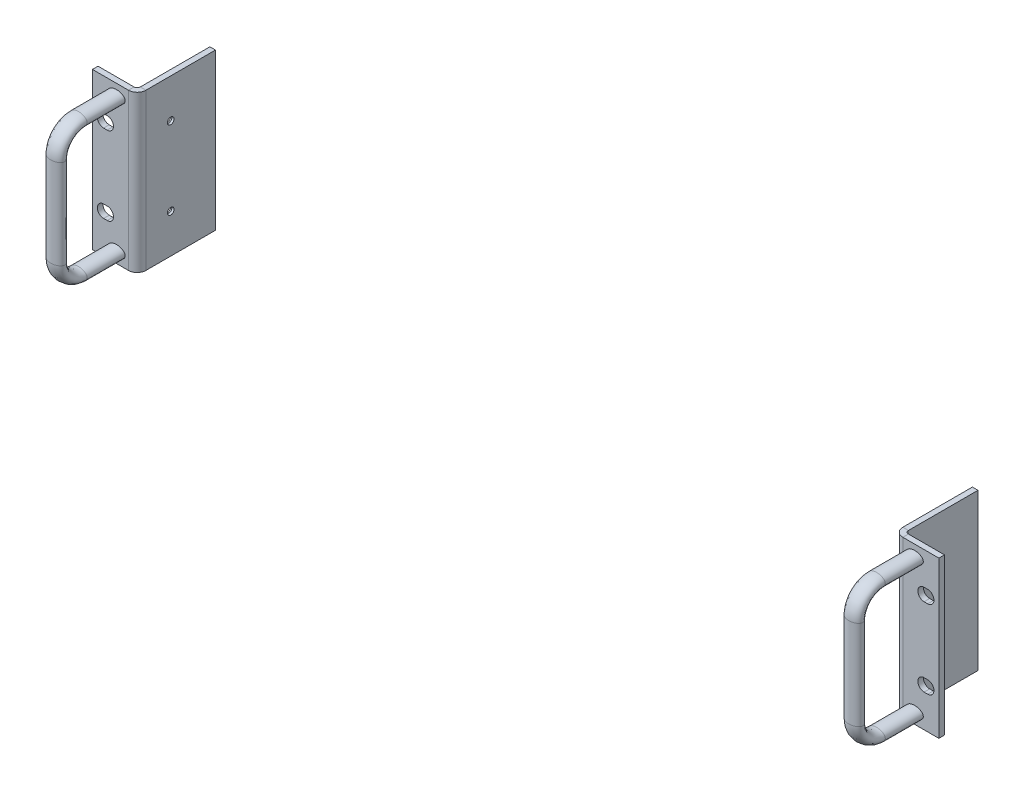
ISO-10303-21;
HEADER;
FILE_DESCRIPTION(('STEP AP214'),'2;1');
FILE_NAME('part.step','',(''),(''),'','','');
FILE_SCHEMA(('AUTOMOTIVE_DESIGN { 1 0 10303 214 1 1 1 1 }'));
ENDSEC;
DATA;
#1=APPLICATION_CONTEXT('core data for automotive mechanical design processes');
#2=APPLICATION_PROTOCOL_DEFINITION('international standard','automotive_design',2000,#1);
#3=PRODUCT_CONTEXT('',#1,'mechanical');
#4=PRODUCT('Part','Part','',(#3));
#5=PRODUCT_RELATED_PRODUCT_CATEGORY('part','',(#4));
#6=PRODUCT_DEFINITION_FORMATION('','',#4);
#7=PRODUCT_DEFINITION_CONTEXT('part definition',#1,'design');
#8=PRODUCT_DEFINITION('design','',#6,#7);
#9=PRODUCT_DEFINITION_SHAPE('','',#8);
#10=(LENGTH_UNIT() NAMED_UNIT(*) SI_UNIT(.MILLI.,.METRE.));
#11=(NAMED_UNIT(*) PLANE_ANGLE_UNIT() SI_UNIT($,.RADIAN.));
#12=(NAMED_UNIT(*) SI_UNIT($,.STERADIAN.) SOLID_ANGLE_UNIT());
#13=UNCERTAINTY_MEASURE_WITH_UNIT(LENGTH_MEASURE(1.E-05),#10,'distance_accuracy_value','');
#14=(GEOMETRIC_REPRESENTATION_CONTEXT(3) GLOBAL_UNCERTAINTY_ASSIGNED_CONTEXT((#13)) GLOBAL_UNIT_ASSIGNED_CONTEXT((#10,
#11,#12)) REPRESENTATION_CONTEXT('',''));
#15=CARTESIAN_POINT('',(0.,0.,0.));
#16=DIRECTION('',(0.,0.,1.));
#17=DIRECTION('',(1.,0.,0.));
#18=AXIS2_PLACEMENT_3D('',#15,#16,#17);
#19=CARTESIAN_POINT('',(-226.568000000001,-38.1,21.59));
#20=DIRECTION('',(0.,0.,-1.));
#21=DIRECTION('',(-1.,0.,0.));
#22=AXIS2_PLACEMENT_3D('',#19,#20,#21);
#23=ELLIPSE('',#22,4.88490465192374,3.11316991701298);
#24=DIRECTION('',(0.,0.,-1.));
#25=VECTOR('',#24,1.);
#26=SURFACE_OF_LINEAR_EXTRUSION('',#23,#25);
#27=CARTESIAN_POINT('',(-231.452904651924,-38.1,21.59));
#28=VERTEX_POINT('',#27);
#29=EDGE_CURVE('P0_E24',#28,#28,#23,.T.);
#30=ORIENTED_EDGE('',*,*,#29,.T.);
#31=EDGE_LOOP('',(#30));
#32=FACE_BOUND('',#31,.T.);
#33=CARTESIAN_POINT('',(-226.568000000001,-38.1,0.));
#34=DIRECTION('',(0.,0.,-1.));
#35=DIRECTION('',(-1.,0.,0.));
#36=AXIS2_PLACEMENT_3D('',#33,#34,#35);
#37=ELLIPSE('',#36,4.88490465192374,3.11316991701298);
#38=CARTESIAN_POINT('',(-231.452904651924,-38.1,0.));
#39=VERTEX_POINT('',#38);
#40=EDGE_CURVE('P0_E11',#39,#39,#37,.T.);
#41=ORIENTED_EDGE('',*,*,#40,.F.);
#42=EDGE_LOOP('',(#41));
#43=FACE_BOUND('',#42,.T.);
#44=ADVANCED_FACE('P0_F17',(#32,#43),#26,.T.);
#45=CARTESIAN_POINT('',(-226.568000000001,-25.4,34.29));
#46=DIRECTION('',(0.,-1.,0.));
#47=DIRECTION('',(-1.,0.,0.));
#48=AXIS2_PLACEMENT_3D('',#45,#46,#47);
#49=ELLIPSE('',#48,4.88490465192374,3.11316991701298);
#50=CARTESIAN_POINT('',(-231.452904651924,-25.4,21.59));
#51=DIRECTION('',(1.,0.,0.));
#52=AXIS1_PLACEMENT('',#50,#51);
#53=SURFACE_OF_REVOLUTION('',#49,#52);
#54=CARTESIAN_POINT('',(-231.452904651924,-25.4,34.29));
#55=VERTEX_POINT('',#54);
#56=EDGE_CURVE('P0_E74',#55,#55,#49,.T.);
#57=ORIENTED_EDGE('',*,*,#56,.T.);
#58=EDGE_LOOP('',(#57));
#59=FACE_BOUND('',#58,.T.);
#60=ORIENTED_EDGE('',*,*,#29,.F.);
#61=EDGE_LOOP('',(#60));
#62=FACE_BOUND('',#61,.T.);
#63=ADVANCED_FACE('P0_F69',(#59,#62),#53,.F.);
#64=CARTESIAN_POINT('',(-226.568000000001,25.4,34.29));
#65=DIRECTION('',(0.,-1.,0.));
#66=DIRECTION('',(-1.,0.,0.));
#67=AXIS2_PLACEMENT_3D('',#64,#65,#66);
#68=ELLIPSE('',#67,4.88490465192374,3.11316991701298);
#69=DIRECTION('',(0.,-1.,0.));
#70=VECTOR('',#69,1.);
#71=SURFACE_OF_LINEAR_EXTRUSION('',#68,#70);
#72=CARTESIAN_POINT('',(-231.452904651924,25.4,34.29));
#73=VERTEX_POINT('',#72);
#74=EDGE_CURVE('P0_E56',#73,#73,#68,.T.);
#75=ORIENTED_EDGE('',*,*,#74,.T.);
#76=EDGE_LOOP('',(#75));
#77=FACE_BOUND('',#76,.T.);
#78=ORIENTED_EDGE('',*,*,#56,.F.);
#79=EDGE_LOOP('',(#78));
#80=FACE_BOUND('',#79,.T.);
#81=ADVANCED_FACE('P0_F66',(#77,#80),#71,.T.);
#82=CARTESIAN_POINT('',(-226.568000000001,38.1,21.59));
#83=DIRECTION('',(0.,0.,1.));
#84=DIRECTION('',(-1.,0.,0.));
#85=AXIS2_PLACEMENT_3D('',#82,#83,#84);
#86=ELLIPSE('',#85,4.88490465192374,3.11316991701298);
#87=CARTESIAN_POINT('',(-231.452904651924,25.4,21.59));
#88=DIRECTION('',(1.,0.,0.));
#89=AXIS1_PLACEMENT('',#87,#88);
#90=SURFACE_OF_REVOLUTION('',#86,#89);
#91=CARTESIAN_POINT('',(-231.452904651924,38.1,21.59));
#92=VERTEX_POINT('',#91);
#93=EDGE_CURVE('P0_E52',#92,#92,#86,.T.);
#94=ORIENTED_EDGE('',*,*,#93,.T.);
#95=EDGE_LOOP('',(#94));
#96=FACE_BOUND('',#95,.T.);
#97=ORIENTED_EDGE('',*,*,#74,.F.);
#98=EDGE_LOOP('',(#97));
#99=FACE_BOUND('',#98,.T.);
#100=ADVANCED_FACE('P0_F63',(#96,#99),#90,.F.);
#101=DIRECTION('',(0.,0.,-1.));
#102=VECTOR('',#101,1.);
#103=SURFACE_OF_LINEAR_EXTRUSION('',#86,#102);
#104=ORIENTED_EDGE('',*,*,#93,.F.);
#105=EDGE_LOOP('',(#104));
#106=FACE_BOUND('',#105,.T.);
#107=CARTESIAN_POINT('',(-226.568000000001,38.1,0.));
#108=DIRECTION('',(0.,0.,1.));
#109=DIRECTION('',(-1.,0.,0.));
#110=AXIS2_PLACEMENT_3D('',#107,#108,#109);
#111=ELLIPSE('',#110,4.88490465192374,3.11316991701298);
#112=CARTESIAN_POINT('',(-231.452904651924,38.1,0.));
#113=VERTEX_POINT('',#112);
#114=EDGE_CURVE('P0_E51',#113,#113,#111,.T.);
#115=ORIENTED_EDGE('',*,*,#114,.T.);
#116=EDGE_LOOP('',(#115));
#117=FACE_BOUND('',#116,.T.);
#118=ADVANCED_FACE('P0_F60',(#106,#117),#103,.F.);
#119=CARTESIAN_POINT('',(-226.568000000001,-38.1,0.));
#120=DIRECTION('',(0.,0.,-1.));
#121=DIRECTION('',(1.,0.,0.));
#122=AXIS2_PLACEMENT_3D('',#119,#120,#121);
#123=PLANE('',#122);
#124=CARTESIAN_POINT('',(-226.568000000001,-38.1,0.));
#125=DIRECTION('',(0.,0.,-1.));
#126=DIRECTION('',(-1.,0.,0.));
#127=AXIS2_PLACEMENT_3D('',#124,#125,#126);
#128=CIRCLE('',#127,1.7272);
#129=CARTESIAN_POINT('',(-228.295200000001,-38.1,0.));
#130=VERTEX_POINT('',#129);
#131=EDGE_CURVE('P0_E41',#130,#130,#128,.T.);
#132=ORIENTED_EDGE('',*,*,#131,.F.);
#133=EDGE_LOOP('',(#132));
#134=FACE_BOUND('',#133,.T.);
#135=ORIENTED_EDGE('',*,*,#40,.T.);
#136=EDGE_LOOP('',(#135));
#137=FACE_BOUND('',#136,.T.);
#138=ADVANCED_FACE('P0_F123',(#134,#137),#123,.T.);
#139=CARTESIAN_POINT('',(-226.568000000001,38.1,0.));
#140=DIRECTION('',(0.,0.,1.));
#141=DIRECTION('',(1.,0.,0.));
#142=AXIS2_PLACEMENT_3D('',#139,#140,#141);
#143=PLANE('',#142);
#144=CARTESIAN_POINT('',(-226.568000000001,38.1,0.));
#145=DIRECTION('',(0.,0.,-1.));
#146=DIRECTION('',(-1.,0.,0.));
#147=AXIS2_PLACEMENT_3D('',#144,#145,#146);
#148=CIRCLE('',#147,1.7272);
#149=CARTESIAN_POINT('',(-228.295200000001,38.1,0.));
#150=VERTEX_POINT('',#149);
#151=EDGE_CURVE('P0_E40',#150,#150,#148,.T.);
#152=ORIENTED_EDGE('',*,*,#151,.F.);
#153=EDGE_LOOP('',(#152));
#154=FACE_BOUND('',#153,.T.);
#155=ORIENTED_EDGE('',*,*,#114,.F.);
#156=EDGE_LOOP('',(#155));
#157=FACE_BOUND('',#156,.T.);
#158=ADVANCED_FACE('P0_F132',(#154,#157),#143,.F.);
#159=CARTESIAN_POINT('',(-226.568000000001,38.1,10.70864));
#160=DIRECTION('',(0.,0.,-1.));
#161=DIRECTION('',(-1.,0.,0.));
#162=AXIS2_PLACEMENT_3D('',#159,#160,#161);
#163=CONICAL_SURFACE('',#162,1.7272,1.02974425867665);
#164=CARTESIAN_POINT('',(-226.568000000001,38.1,11.7464464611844));
#165=VERTEX_POINT('',#164);
#166=VERTEX_LOOP('',#165);
#167=FACE_BOUND('',#166,.T.);
#168=CARTESIAN_POINT('',(-226.568000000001,38.1,10.70864));
#169=DIRECTION('',(0.,0.,-1.));
#170=DIRECTION('',(-1.,0.,0.));
#171=AXIS2_PLACEMENT_3D('',#168,#169,#170);
#172=CIRCLE('',#171,1.7272);
#173=CARTESIAN_POINT('',(-228.295200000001,38.1,10.70864));
#174=VERTEX_POINT('',#173);
#175=EDGE_CURVE('P0_E44',#174,#174,#172,.T.);
#176=ORIENTED_EDGE('',*,*,#175,.T.);
#177=EDGE_LOOP('',(#176));
#178=FACE_BOUND('',#177,.T.);
#179=ADVANCED_FACE('P0_F142',(#167,#178),#163,.F.);
#180=CARTESIAN_POINT('',(-226.568000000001,38.1,0.));
#181=DIRECTION('',(0.,0.,-1.));
#182=DIRECTION('',(-1.,0.,0.));
#183=AXIS2_PLACEMENT_3D('',#180,#181,#182);
#184=CYLINDRICAL_SURFACE('',#183,1.7272);
#185=ORIENTED_EDGE('',*,*,#175,.F.);
#186=EDGE_LOOP('',(#185));
#187=FACE_BOUND('',#186,.T.);
#188=ORIENTED_EDGE('',*,*,#151,.T.);
#189=EDGE_LOOP('',(#188));
#190=FACE_BOUND('',#189,.T.);
#191=ADVANCED_FACE('P0_F34',(#187,#190),#184,.F.);
#192=CARTESIAN_POINT('',(-226.568000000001,-38.1,10.70864));
#193=DIRECTION('',(0.,0.,-1.));
#194=DIRECTION('',(-1.,0.,0.));
#195=AXIS2_PLACEMENT_3D('',#192,#193,#194);
#196=CONICAL_SURFACE('',#195,1.7272,1.02974425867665);
#197=CARTESIAN_POINT('',(-226.568000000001,-38.1,11.7464464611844));
#198=VERTEX_POINT('',#197);
#199=VERTEX_LOOP('',#198);
#200=FACE_BOUND('',#199,.T.);
#201=CARTESIAN_POINT('',(-226.568000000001,-38.1,10.70864));
#202=DIRECTION('',(0.,0.,-1.));
#203=DIRECTION('',(-1.,0.,0.));
#204=AXIS2_PLACEMENT_3D('',#201,#202,#203);
#205=CIRCLE('',#204,1.7272);
#206=CARTESIAN_POINT('',(-228.295200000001,-38.1,10.70864));
#207=VERTEX_POINT('',#206);
#208=EDGE_CURVE('P0_E38',#207,#207,#205,.T.);
#209=ORIENTED_EDGE('',*,*,#208,.T.);
#210=EDGE_LOOP('',(#209));
#211=FACE_BOUND('',#210,.T.);
#212=ADVANCED_FACE('P0_F30',(#200,#211),#196,.F.);
#213=CARTESIAN_POINT('',(-226.568000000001,-38.1,0.));
#214=DIRECTION('',(0.,0.,-1.));
#215=DIRECTION('',(-1.,0.,0.));
#216=AXIS2_PLACEMENT_3D('',#213,#214,#215);
#217=CYLINDRICAL_SURFACE('',#216,1.7272);
#218=ORIENTED_EDGE('',*,*,#208,.F.);
#219=EDGE_LOOP('',(#218));
#220=FACE_BOUND('',#219,.T.);
#221=ORIENTED_EDGE('',*,*,#131,.T.);
#222=EDGE_LOOP('',(#221));
#223=FACE_BOUND('',#222,.T.);
#224=ADVANCED_FACE('P0_F33',(#220,#223),#217,.F.);
#225=CLOSED_SHELL('',(#44,#63,#81,#100,#118,#138,#158,#179,#191,#212,#224));
#226=MANIFOLD_SOLID_BREP('P0_B1',#225);
#227=CARTESIAN_POINT('',(226.568000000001,-38.1000000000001,21.589999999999));
#228=DIRECTION('',(0.,0.,-1.));
#229=DIRECTION('',(-1.,0.,0.));
#230=AXIS2_PLACEMENT_3D('',#227,#228,#229);
#231=ELLIPSE('',#230,4.88490465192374,3.11316991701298);
#232=DIRECTION('',(0.,0.,-1.));
#233=VECTOR('',#232,1.);
#234=SURFACE_OF_LINEAR_EXTRUSION('',#231,#233);
#235=CARTESIAN_POINT('',(221.683095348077,-38.1000000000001,21.589999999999));
#236=VERTEX_POINT('',#235);
#237=EDGE_CURVE('P1_E23',#236,#236,#231,.T.);
#238=ORIENTED_EDGE('',*,*,#237,.T.);
#239=EDGE_LOOP('',(#238));
#240=FACE_BOUND('',#239,.T.);
#241=CARTESIAN_POINT('',(226.568000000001,-38.1000000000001,-9.68409380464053E-13));
#242=DIRECTION('',(0.,0.,-1.));
#243=DIRECTION('',(-1.,0.,0.));
#244=AXIS2_PLACEMENT_3D('',#241,#242,#243);
#245=ELLIPSE('',#244,4.88490465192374,3.11316991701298);
#246=CARTESIAN_POINT('',(221.683095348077,-38.1000000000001,-9.68409380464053E-13));
#247=VERTEX_POINT('',#246);
#248=EDGE_CURVE('P1_E10',#247,#247,#245,.T.);
#249=ORIENTED_EDGE('',*,*,#248,.F.);
#250=EDGE_LOOP('',(#249));
#251=FACE_BOUND('',#250,.T.);
#252=ADVANCED_FACE('P1_F16',(#240,#251),#234,.T.);
#253=CARTESIAN_POINT('',(226.568000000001,-25.4000000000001,34.289999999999));
#254=DIRECTION('',(0.,-1.,0.));
#255=DIRECTION('',(-1.,0.,0.));
#256=AXIS2_PLACEMENT_3D('',#253,#254,#255);
#257=ELLIPSE('',#256,4.88490465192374,3.11316991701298);
#258=CARTESIAN_POINT('',(221.683095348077,-25.4000000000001,21.589999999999));
#259=DIRECTION('',(1.,0.,0.));
#260=AXIS1_PLACEMENT('',#258,#259);
#261=SURFACE_OF_REVOLUTION('',#257,#260);
#262=CARTESIAN_POINT('',(221.683095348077,-25.4000000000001,34.289999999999));
#263=VERTEX_POINT('',#262);
#264=EDGE_CURVE('P1_E73',#263,#263,#257,.T.);
#265=ORIENTED_EDGE('',*,*,#264,.T.);
#266=EDGE_LOOP('',(#265));
#267=FACE_BOUND('',#266,.T.);
#268=ORIENTED_EDGE('',*,*,#237,.F.);
#269=EDGE_LOOP('',(#268));
#270=FACE_BOUND('',#269,.T.);
#271=ADVANCED_FACE('P1_F68',(#267,#270),#261,.F.);
#272=CARTESIAN_POINT('',(226.568000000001,25.3999999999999,34.289999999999));
#273=DIRECTION('',(0.,-1.,0.));
#274=DIRECTION('',(-1.,0.,0.));
#275=AXIS2_PLACEMENT_3D('',#272,#273,#274);
#276=ELLIPSE('',#275,4.88490465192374,3.11316991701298);
#277=DIRECTION('',(0.,-1.,0.));
#278=VECTOR('',#277,1.);
#279=SURFACE_OF_LINEAR_EXTRUSION('',#276,#278);
#280=CARTESIAN_POINT('',(221.683095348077,25.3999999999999,34.289999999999));
#281=VERTEX_POINT('',#280);
#282=EDGE_CURVE('P1_E55',#281,#281,#276,.T.);
#283=ORIENTED_EDGE('',*,*,#282,.T.);
#284=EDGE_LOOP('',(#283));
#285=FACE_BOUND('',#284,.T.);
#286=ORIENTED_EDGE('',*,*,#264,.F.);
#287=EDGE_LOOP('',(#286));
#288=FACE_BOUND('',#287,.T.);
#289=ADVANCED_FACE('P1_F65',(#285,#288),#279,.T.);
#290=CARTESIAN_POINT('',(226.568000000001,38.0999999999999,21.5899999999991));
#291=DIRECTION('',(0.,0.,1.));
#292=DIRECTION('',(-1.,0.,0.));
#293=AXIS2_PLACEMENT_3D('',#290,#291,#292);
#294=ELLIPSE('',#293,4.88490465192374,3.11316991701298);
#295=CARTESIAN_POINT('',(221.683095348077,25.3999999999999,21.5899999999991));
#296=DIRECTION('',(1.,0.,0.));
#297=AXIS1_PLACEMENT('',#295,#296);
#298=SURFACE_OF_REVOLUTION('',#294,#297);
#299=CARTESIAN_POINT('',(221.683095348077,38.0999999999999,21.5899999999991));
#300=VERTEX_POINT('',#299);
#301=EDGE_CURVE('P1_E51',#300,#300,#294,.T.);
#302=ORIENTED_EDGE('',*,*,#301,.T.);
#303=EDGE_LOOP('',(#302));
#304=FACE_BOUND('',#303,.T.);
#305=ORIENTED_EDGE('',*,*,#282,.F.);
#306=EDGE_LOOP('',(#305));
#307=FACE_BOUND('',#306,.T.);
#308=ADVANCED_FACE('P1_F62',(#304,#307),#298,.F.);
#309=DIRECTION('',(0.,0.,-1.));
#310=VECTOR('',#309,1.);
#311=SURFACE_OF_LINEAR_EXTRUSION('',#294,#310);
#312=ORIENTED_EDGE('',*,*,#301,.F.);
#313=EDGE_LOOP('',(#312));
#314=FACE_BOUND('',#313,.T.);
#315=CARTESIAN_POINT('',(226.568000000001,38.0999999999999,-9.40653804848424E-13));
#316=DIRECTION('',(0.,0.,1.));
#317=DIRECTION('',(-1.,0.,0.));
#318=AXIS2_PLACEMENT_3D('',#315,#316,#317);
#319=ELLIPSE('',#318,4.88490465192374,3.11316991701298);
#320=CARTESIAN_POINT('',(221.683095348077,38.0999999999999,-9.40653804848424E-13));
#321=VERTEX_POINT('',#320);
#322=EDGE_CURVE('P1_E50',#321,#321,#319,.T.);
#323=ORIENTED_EDGE('',*,*,#322,.T.);
#324=EDGE_LOOP('',(#323));
#325=FACE_BOUND('',#324,.T.);
#326=ADVANCED_FACE('P1_F59',(#314,#325),#311,.F.);
#327=CARTESIAN_POINT('',(226.568000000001,-38.1000000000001,-9.68409380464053E-13));
#328=DIRECTION('',(0.,0.,-1.));
#329=DIRECTION('',(1.,0.,0.));
#330=AXIS2_PLACEMENT_3D('',#327,#328,#329);
#331=PLANE('',#330);
#332=CARTESIAN_POINT('',(226.568000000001,-38.1000000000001,-9.40754899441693E-13));
#333=DIRECTION('',(0.,0.,-1.));
#334=DIRECTION('',(-1.,0.,0.));
#335=AXIS2_PLACEMENT_3D('',#332,#333,#334);
#336=CIRCLE('',#335,1.7272);
#337=CARTESIAN_POINT('',(224.840800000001,-38.1000000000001,-9.40754899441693E-13));
#338=VERTEX_POINT('',#337);
#339=EDGE_CURVE('P1_E40',#338,#338,#336,.T.);
#340=ORIENTED_EDGE('',*,*,#339,.F.);
#341=EDGE_LOOP('',(#340));
#342=FACE_BOUND('',#341,.T.);
#343=ORIENTED_EDGE('',*,*,#248,.T.);
#344=EDGE_LOOP('',(#343));
#345=FACE_BOUND('',#344,.T.);
#346=ADVANCED_FACE('P1_F122',(#342,#345),#331,.T.);
#347=CARTESIAN_POINT('',(226.568000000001,38.0999999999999,-9.40653804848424E-13));
#348=DIRECTION('',(0.,0.,1.));
#349=DIRECTION('',(1.,0.,0.));
#350=AXIS2_PLACEMENT_3D('',#347,#348,#349);
#351=PLANE('',#350);
#352=CARTESIAN_POINT('',(226.568000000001,38.0999999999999,-9.40754899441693E-13));
#353=DIRECTION('',(0.,0.,-1.));
#354=DIRECTION('',(-1.,0.,0.));
#355=AXIS2_PLACEMENT_3D('',#352,#353,#354);
#356=CIRCLE('',#355,1.7272);
#357=CARTESIAN_POINT('',(224.840800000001,38.0999999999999,-9.40754899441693E-13));
#358=VERTEX_POINT('',#357);
#359=EDGE_CURVE('P1_E39',#358,#358,#356,.T.);
#360=ORIENTED_EDGE('',*,*,#359,.F.);
#361=EDGE_LOOP('',(#360));
#362=FACE_BOUND('',#361,.T.);
#363=ORIENTED_EDGE('',*,*,#322,.F.);
#364=EDGE_LOOP('',(#363));
#365=FACE_BOUND('',#364,.T.);
#366=ADVANCED_FACE('P1_F131',(#362,#365),#351,.F.);
#367=CARTESIAN_POINT('',(226.568000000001,38.0999999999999,10.7086399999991));
#368=DIRECTION('',(0.,0.,-1.));
#369=DIRECTION('',(-1.,0.,0.));
#370=AXIS2_PLACEMENT_3D('',#367,#368,#369);
#371=CONICAL_SURFACE('',#370,1.7272,1.02974425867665);
#372=CARTESIAN_POINT('',(226.568000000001,38.0999999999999,11.7464464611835));
#373=VERTEX_POINT('',#372);
#374=VERTEX_LOOP('',#373);
#375=FACE_BOUND('',#374,.T.);
#376=CARTESIAN_POINT('',(226.568000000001,38.0999999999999,10.7086399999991));
#377=DIRECTION('',(0.,0.,-1.));
#378=DIRECTION('',(-1.,0.,0.));
#379=AXIS2_PLACEMENT_3D('',#376,#377,#378);
#380=CIRCLE('',#379,1.7272);
#381=CARTESIAN_POINT('',(224.840800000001,38.0999999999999,10.7086399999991));
#382=VERTEX_POINT('',#381);
#383=EDGE_CURVE('P1_E43',#382,#382,#380,.T.);
#384=ORIENTED_EDGE('',*,*,#383,.T.);
#385=EDGE_LOOP('',(#384));
#386=FACE_BOUND('',#385,.T.);
#387=ADVANCED_FACE('P1_F141',(#375,#386),#371,.F.);
#388=CARTESIAN_POINT('',(226.568000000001,38.0999999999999,-9.40653804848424E-13));
#389=DIRECTION('',(0.,0.,-1.));
#390=DIRECTION('',(-1.,0.,0.));
#391=AXIS2_PLACEMENT_3D('',#388,#389,#390);
#392=CYLINDRICAL_SURFACE('',#391,1.7272);
#393=ORIENTED_EDGE('',*,*,#383,.F.);
#394=EDGE_LOOP('',(#393));
#395=FACE_BOUND('',#394,.T.);
#396=ORIENTED_EDGE('',*,*,#359,.T.);
#397=EDGE_LOOP('',(#396));
#398=FACE_BOUND('',#397,.T.);
#399=ADVANCED_FACE('P1_F33',(#395,#398),#392,.F.);
#400=CARTESIAN_POINT('',(226.568000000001,-38.1000000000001,10.7086399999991));
#401=DIRECTION('',(0.,0.,-1.));
#402=DIRECTION('',(-1.,0.,0.));
#403=AXIS2_PLACEMENT_3D('',#400,#401,#402);
#404=CONICAL_SURFACE('',#403,1.7272,1.02974425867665);
#405=CARTESIAN_POINT('',(226.568000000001,-38.1000000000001,11.7464464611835));
#406=VERTEX_POINT('',#405);
#407=VERTEX_LOOP('',#406);
#408=FACE_BOUND('',#407,.T.);
#409=CARTESIAN_POINT('',(226.568000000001,-38.1000000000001,10.7086399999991));
#410=DIRECTION('',(0.,0.,-1.));
#411=DIRECTION('',(-1.,0.,0.));
#412=AXIS2_PLACEMENT_3D('',#409,#410,#411);
#413=CIRCLE('',#412,1.7272);
#414=CARTESIAN_POINT('',(224.840800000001,-38.1000000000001,10.7086399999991));
#415=VERTEX_POINT('',#414);
#416=EDGE_CURVE('P1_E37',#415,#415,#413,.T.);
#417=ORIENTED_EDGE('',*,*,#416,.T.);
#418=EDGE_LOOP('',(#417));
#419=FACE_BOUND('',#418,.T.);
#420=ADVANCED_FACE('P1_F29',(#408,#419),#404,.F.);
#421=CARTESIAN_POINT('',(226.568000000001,-38.1000000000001,-9.40653804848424E-13));
#422=DIRECTION('',(0.,0.,-1.));
#423=DIRECTION('',(-1.,0.,0.));
#424=AXIS2_PLACEMENT_3D('',#421,#422,#423);
#425=CYLINDRICAL_SURFACE('',#424,1.7272);
#426=ORIENTED_EDGE('',*,*,#416,.F.);
#427=EDGE_LOOP('',(#426));
#428=FACE_BOUND('',#427,.T.);
#429=ORIENTED_EDGE('',*,*,#339,.T.);
#430=EDGE_LOOP('',(#429));
#431=FACE_BOUND('',#430,.T.);
#432=ADVANCED_FACE('P1_F32',(#428,#431),#425,.F.);
#433=CLOSED_SHELL('',(#252,#271,#289,#308,#326,#346,#366,#387,#399,#420,#432));
#434=MANIFOLD_SOLID_BREP('P1_B1',#433);
#435=CARTESIAN_POINT('',(-218.059000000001,44.323,0.));
#436=DIRECTION('',(0.,0.,1.));
#437=DIRECTION('',(1.,0.,0.));
#438=AXIS2_PLACEMENT_3D('',#435,#436,#437);
#439=PLANE('',#438);
#440=CARTESIAN_POINT('',(-226.568000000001,38.1,0.));
#441=DIRECTION('',(0.,0.,-1.));
#442=DIRECTION('',(-1.,0.,0.));
#443=AXIS2_PLACEMENT_3D('',#440,#441,#442);
#444=CIRCLE('',#443,2.15265);
#445=CARTESIAN_POINT('',(-228.720650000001,38.1,0.));
#446=VERTEX_POINT('',#445);
#447=EDGE_CURVE('P2_E581',#446,#446,#444,.T.);
#448=ORIENTED_EDGE('',*,*,#447,.T.);
#449=EDGE_LOOP('',(#448));
#450=FACE_BOUND('',#449,.T.);
#451=DIRECTION('',(1.,0.,0.));
#452=VECTOR('',#451,1.);
#453=CARTESIAN_POINT('',(-214.884000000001,-18.6689999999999,0.));
#454=LINE('',#453,#452);
#455=CARTESIAN_POINT('',(-233.934000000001,-18.669,0.));
#456=VERTEX_POINT('',#455);
#457=CARTESIAN_POINT('',(-231.902000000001,-18.669,0.));
#458=VERTEX_POINT('',#457);
#459=EDGE_CURVE('P2_E177',#456,#458,#454,.T.);
#460=ORIENTED_EDGE('',*,*,#459,.T.);
#461=CARTESIAN_POINT('',(-231.902000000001,-22.225,0.));
#462=DIRECTION('',(0.,0.,1.));
#463=DIRECTION('',(1.,0.,0.));
#464=AXIS2_PLACEMENT_3D('',#461,#462,#463);
#465=CIRCLE('',#464,3.55600000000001);
#466=CARTESIAN_POINT('',(-231.902000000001,-25.781,0.));
#467=VERTEX_POINT('',#466);
#468=EDGE_CURVE('P2_E174',#458,#467,#465,.F.);
#469=ORIENTED_EDGE('',*,*,#468,.T.);
#470=DIRECTION('',(1.,0.,0.));
#471=VECTOR('',#470,1.);
#472=CARTESIAN_POINT('',(-214.884000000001,-25.7810000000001,0.));
#473=LINE('',#472,#471);
#474=CARTESIAN_POINT('',(-233.934000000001,-25.781,0.));
#475=VERTEX_POINT('',#474);
#476=EDGE_CURVE('P2_E183',#475,#467,#473,.T.);
#477=ORIENTED_EDGE('',*,*,#476,.F.);
#478=CARTESIAN_POINT('',(-233.934000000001,-22.225,0.));
#479=DIRECTION('',(0.,0.,1.));
#480=DIRECTION('',(1.,0.,0.));
#481=AXIS2_PLACEMENT_3D('',#478,#479,#480);
#482=CIRCLE('',#481,3.556);
#483=EDGE_CURVE('P2_E180',#475,#456,#482,.F.);
#484=ORIENTED_EDGE('',*,*,#483,.T.);
#485=EDGE_LOOP('',(#460,#469,#477,#484));
#486=FACE_BOUND('',#485,.T.);
#487=DIRECTION('',(1.,0.,0.));
#488=VECTOR('',#487,1.);
#489=CARTESIAN_POINT('',(-218.059000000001,44.323,0.));
#490=LINE('',#489,#488);
#491=CARTESIAN_POINT('',(-219.837000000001,44.323,0.));
#492=VERTEX_POINT('',#491);
#493=CARTESIAN_POINT('',(-240.284000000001,44.323,0.));
#494=VERTEX_POINT('',#493);
#495=EDGE_CURVE('P2_E240',#492,#494,#490,.F.);
#496=ORIENTED_EDGE('',*,*,#495,.T.);
#497=DIRECTION('',(0.,1.,0.));
#498=VECTOR('',#497,1.);
#499=CARTESIAN_POINT('',(-240.284000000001,44.323,0.));
#500=LINE('',#499,#498);
#501=CARTESIAN_POINT('',(-240.284000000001,-44.323,0.));
#502=VERTEX_POINT('',#501);
#503=EDGE_CURVE('P2_E251',#494,#502,#500,.F.);
#504=ORIENTED_EDGE('',*,*,#503,.T.);
#505=DIRECTION('',(1.,0.,0.));
#506=VECTOR('',#505,1.);
#507=CARTESIAN_POINT('',(-218.059000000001,-44.323,0.));
#508=LINE('',#507,#506);
#509=CARTESIAN_POINT('',(-219.837000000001,-44.323,0.));
#510=VERTEX_POINT('',#509);
#511=EDGE_CURVE('P2_E248',#510,#502,#508,.F.);
#512=ORIENTED_EDGE('',*,*,#511,.F.);
#513=DIRECTION('',(0.,1.,0.));
#514=VECTOR('',#513,1.);
#515=CARTESIAN_POINT('',(-219.837000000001,44.323,0.));
#516=LINE('',#515,#514);
#517=EDGE_CURVE('P2_E232',#492,#510,#516,.F.);
#518=ORIENTED_EDGE('',*,*,#517,.F.);
#519=EDGE_LOOP('',(#496,#504,#512,#518));
#520=FACE_BOUND('',#519,.T.);
#521=DIRECTION('',(1.,0.,0.));
#522=VECTOR('',#521,1.);
#523=CARTESIAN_POINT('',(-214.884000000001,18.6689999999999,0.));
#524=LINE('',#523,#522);
#525=CARTESIAN_POINT('',(-233.934000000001,18.669,0.));
#526=VERTEX_POINT('',#525);
#527=CARTESIAN_POINT('',(-231.902000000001,18.669,0.));
#528=VERTEX_POINT('',#527);
#529=EDGE_CURVE('P2_E41',#526,#528,#524,.T.);
#530=ORIENTED_EDGE('',*,*,#529,.F.);
#531=CARTESIAN_POINT('',(-233.934000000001,22.225,0.));
#532=DIRECTION('',(0.,0.,1.));
#533=DIRECTION('',(1.,0.,0.));
#534=AXIS2_PLACEMENT_3D('',#531,#532,#533);
#535=CIRCLE('',#534,3.556);
#536=CARTESIAN_POINT('',(-233.934000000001,25.781,0.));
#537=VERTEX_POINT('',#536);
#538=EDGE_CURVE('P2_E138',#537,#526,#535,.T.);
#539=ORIENTED_EDGE('',*,*,#538,.F.);
#540=DIRECTION('',(1.,0.,0.));
#541=VECTOR('',#540,1.);
#542=CARTESIAN_POINT('',(-214.884000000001,25.7810000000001,0.));
#543=LINE('',#542,#541);
#544=CARTESIAN_POINT('',(-231.902000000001,25.781,0.));
#545=VERTEX_POINT('',#544);
#546=EDGE_CURVE('P2_E158',#537,#545,#543,.T.);
#547=ORIENTED_EDGE('',*,*,#546,.T.);
#548=CARTESIAN_POINT('',(-231.902000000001,22.225,0.));
#549=DIRECTION('',(0.,0.,1.));
#550=DIRECTION('',(1.,0.,0.));
#551=AXIS2_PLACEMENT_3D('',#548,#549,#550);
#552=CIRCLE('',#551,3.55600000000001);
#553=EDGE_CURVE('P2_E152',#528,#545,#552,.T.);
#554=ORIENTED_EDGE('',*,*,#553,.F.);
#555=EDGE_LOOP('',(#530,#539,#547,#554));
#556=FACE_BOUND('',#555,.T.);
#557=CARTESIAN_POINT('',(-226.568000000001,-38.1,0.));
#558=DIRECTION('',(0.,0.,-1.));
#559=DIRECTION('',(-1.,0.,0.));
#560=AXIS2_PLACEMENT_3D('',#557,#558,#559);
#561=CIRCLE('',#560,2.15265);
#562=CARTESIAN_POINT('',(-228.720650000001,-38.1,0.));
#563=VERTEX_POINT('',#562);
#564=EDGE_CURVE('P2_E591',#563,#563,#561,.T.);
#565=ORIENTED_EDGE('',*,*,#564,.T.);
#566=EDGE_LOOP('',(#565));
#567=FACE_BOUND('',#566,.T.);
#568=ADVANCED_FACE('P2_F17',(#450,#486,#520,#556,#567),#439,.T.);
#569=CARTESIAN_POINT('',(-218.059000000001,44.323,-3.175));
#570=DIRECTION('',(0.,0.,1.));
#571=DIRECTION('',(1.,0.,0.));
#572=AXIS2_PLACEMENT_3D('',#569,#570,#571);
#573=PLANE('',#572);
#574=CARTESIAN_POINT('',(-226.568000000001,38.1,-3.175));
#575=DIRECTION('',(0.,0.,-1.));
#576=DIRECTION('',(-1.,0.,0.));
#577=AXIS2_PLACEMENT_3D('',#574,#575,#576);
#578=CIRCLE('',#577,4.2164);
#579=CARTESIAN_POINT('',(-230.784400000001,38.1,-3.175));
#580=VERTEX_POINT('',#579);
#581=EDGE_CURVE('P2_E579',#580,#580,#578,.T.);
#582=ORIENTED_EDGE('',*,*,#581,.F.);
#583=EDGE_LOOP('',(#582));
#584=FACE_BOUND('',#583,.T.);
#585=CARTESIAN_POINT('',(-233.934000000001,22.225,-3.175));
#586=DIRECTION('',(0.,0.,1.));
#587=DIRECTION('',(1.,0.,0.));
#588=AXIS2_PLACEMENT_3D('',#585,#586,#587);
#589=CIRCLE('',#588,3.556);
#590=CARTESIAN_POINT('',(-233.934000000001,18.669,-3.175));
#591=VERTEX_POINT('',#590);
#592=CARTESIAN_POINT('',(-233.934000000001,25.781,-3.175));
#593=VERTEX_POINT('',#592);
#594=EDGE_CURVE('P2_E150',#591,#593,#589,.F.);
#595=ORIENTED_EDGE('',*,*,#594,.F.);
#596=DIRECTION('',(-1.,0.,0.));
#597=VECTOR('',#596,1.);
#598=CARTESIAN_POINT('',(-214.884000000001,18.6689999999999,-3.17499999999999));
#599=LINE('',#598,#597);
#600=CARTESIAN_POINT('',(-231.902000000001,18.669,-3.17499999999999));
#601=VERTEX_POINT('',#600);
#602=EDGE_CURVE('P2_E132',#601,#591,#599,.T.);
#603=ORIENTED_EDGE('',*,*,#602,.F.);
#604=CARTESIAN_POINT('',(-231.902000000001,22.225,-3.175));
#605=DIRECTION('',(0.,0.,1.));
#606=DIRECTION('',(1.,0.,0.));
#607=AXIS2_PLACEMENT_3D('',#604,#605,#606);
#608=CIRCLE('',#607,3.55600000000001);
#609=CARTESIAN_POINT('',(-231.902000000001,25.781,-3.175));
#610=VERTEX_POINT('',#609);
#611=EDGE_CURVE('P2_E141',#610,#601,#608,.F.);
#612=ORIENTED_EDGE('',*,*,#611,.F.);
#613=DIRECTION('',(-1.,0.,0.));
#614=VECTOR('',#613,1.);
#615=CARTESIAN_POINT('',(-214.884000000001,25.7810000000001,-3.17499999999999));
#616=LINE('',#615,#614);
#617=EDGE_CURVE('P2_E33',#610,#593,#616,.T.);
#618=ORIENTED_EDGE('',*,*,#617,.T.);
#619=EDGE_LOOP('',(#595,#603,#612,#618));
#620=FACE_BOUND('',#619,.T.);
#621=DIRECTION('',(-1.,0.,0.));
#622=VECTOR('',#621,1.);
#623=CARTESIAN_POINT('',(-218.059000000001,44.323,-3.175));
#624=LINE('',#623,#622);
#625=CARTESIAN_POINT('',(-219.837000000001,44.323,-3.175));
#626=VERTEX_POINT('',#625);
#627=CARTESIAN_POINT('',(-240.284000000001,44.323,-3.175));
#628=VERTEX_POINT('',#627);
#629=EDGE_CURVE('P2_E206',#626,#628,#624,.T.);
#630=ORIENTED_EDGE('',*,*,#629,.F.);
#631=DIRECTION('',(0.,-1.,0.));
#632=VECTOR('',#631,1.);
#633=CARTESIAN_POINT('',(-219.837000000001,-44.323,-3.17499999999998));
#634=LINE('',#633,#632);
#635=CARTESIAN_POINT('',(-219.837000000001,-44.323,-3.17499999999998));
#636=VERTEX_POINT('',#635);
#637=EDGE_CURVE('P2_E218',#626,#636,#634,.T.);
#638=ORIENTED_EDGE('',*,*,#637,.T.);
#639=DIRECTION('',(-1.,0.,0.));
#640=VECTOR('',#639,1.);
#641=CARTESIAN_POINT('',(-218.059000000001,-44.323,-3.17499999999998));
#642=LINE('',#641,#640);
#643=CARTESIAN_POINT('',(-240.284000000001,-44.323,-3.17499999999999));
#644=VERTEX_POINT('',#643);
#645=EDGE_CURVE('P2_E199',#636,#644,#642,.T.);
#646=ORIENTED_EDGE('',*,*,#645,.T.);
#647=DIRECTION('',(0.,-1.,0.));
#648=VECTOR('',#647,1.);
#649=CARTESIAN_POINT('',(-240.284000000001,44.323,-3.175));
#650=LINE('',#649,#648);
#651=EDGE_CURVE('P2_E202',#628,#644,#650,.T.);
#652=ORIENTED_EDGE('',*,*,#651,.F.);
#653=EDGE_LOOP('',(#630,#638,#646,#652));
#654=FACE_BOUND('',#653,.T.);
#655=CARTESIAN_POINT('',(-231.902000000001,-22.225,-3.17499999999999));
#656=DIRECTION('',(0.,0.,1.));
#657=DIRECTION('',(1.,0.,0.));
#658=AXIS2_PLACEMENT_3D('',#655,#656,#657);
#659=CIRCLE('',#658,3.55600000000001);
#660=CARTESIAN_POINT('',(-231.902000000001,-25.781,-3.17499999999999));
#661=VERTEX_POINT('',#660);
#662=CARTESIAN_POINT('',(-231.902000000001,-18.669,-3.17499999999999));
#663=VERTEX_POINT('',#662);
#664=EDGE_CURVE('P2_E171',#661,#663,#659,.T.);
#665=ORIENTED_EDGE('',*,*,#664,.T.);
#666=DIRECTION('',(-1.,0.,0.));
#667=VECTOR('',#666,1.);
#668=CARTESIAN_POINT('',(-214.884000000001,-18.6689999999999,-3.17499999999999));
#669=LINE('',#668,#667);
#670=CARTESIAN_POINT('',(-233.934000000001,-18.669,-3.17499999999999));
#671=VERTEX_POINT('',#670);
#672=EDGE_CURVE('P2_E189',#663,#671,#669,.T.);
#673=ORIENTED_EDGE('',*,*,#672,.T.);
#674=CARTESIAN_POINT('',(-233.934000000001,-22.225,-3.17499999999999));
#675=DIRECTION('',(0.,0.,1.));
#676=DIRECTION('',(1.,0.,0.));
#677=AXIS2_PLACEMENT_3D('',#674,#675,#676);
#678=CIRCLE('',#677,3.556);
#679=CARTESIAN_POINT('',(-233.934000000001,-25.781,-3.17499999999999));
#680=VERTEX_POINT('',#679);
#681=EDGE_CURVE('P2_E144',#671,#680,#678,.T.);
#682=ORIENTED_EDGE('',*,*,#681,.T.);
#683=DIRECTION('',(-1.,0.,0.));
#684=VECTOR('',#683,1.);
#685=CARTESIAN_POINT('',(-214.884000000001,-25.7810000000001,-3.17499999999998));
#686=LINE('',#685,#684);
#687=EDGE_CURVE('P2_E169',#661,#680,#686,.T.);
#688=ORIENTED_EDGE('',*,*,#687,.F.);
#689=EDGE_LOOP('',(#665,#673,#682,#688));
#690=FACE_BOUND('',#689,.T.);
#691=CARTESIAN_POINT('',(-226.568000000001,-38.1,-3.17499999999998));
#692=DIRECTION('',(0.,0.,-1.));
#693=DIRECTION('',(-1.,0.,0.));
#694=AXIS2_PLACEMENT_3D('',#691,#692,#693);
#695=CIRCLE('',#694,4.2164);
#696=CARTESIAN_POINT('',(-230.784400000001,-38.1,-3.17499999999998));
#697=VERTEX_POINT('',#696);
#698=EDGE_CURVE('P2_E585',#697,#697,#695,.T.);
#699=ORIENTED_EDGE('',*,*,#698,.F.);
#700=EDGE_LOOP('',(#699));
#701=FACE_BOUND('',#700,.T.);
#702=ADVANCED_FACE('P2_F147',(#584,#620,#654,#690,#701),#573,.F.);
#703=CARTESIAN_POINT('',(-218.059000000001,-44.323,-3.17499999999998));
#704=DIRECTION('',(0.,1.,0.));
#705=DIRECTION('',(-1.,0.,0.));
#706=AXIS2_PLACEMENT_3D('',#703,#704,#705);
#707=PLANE('',#706);
#708=DIRECTION('',(0.,0.,-1.));
#709=VECTOR('',#708,1.);
#710=CARTESIAN_POINT('',(-219.837000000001,-44.323,-3.17499999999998));
#711=LINE('',#710,#709);
#712=EDGE_CURVE('P2_E11',#510,#636,#711,.T.);
#713=ORIENTED_EDGE('',*,*,#712,.F.);
#714=ORIENTED_EDGE('',*,*,#511,.T.);
#715=DIRECTION('',(0.,0.,-1.));
#716=VECTOR('',#715,1.);
#717=CARTESIAN_POINT('',(-240.284000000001,-44.323,-3.17499999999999));
#718=LINE('',#717,#716);
#719=EDGE_CURVE('P2_E26',#502,#644,#718,.T.);
#720=ORIENTED_EDGE('',*,*,#719,.T.);
#721=ORIENTED_EDGE('',*,*,#645,.F.);
#722=EDGE_LOOP('',(#713,#714,#720,#721));
#723=FACE_BOUND('',#722,.T.);
#724=ADVANCED_FACE('P2_F270',(#723),#707,.F.);
#725=CARTESIAN_POINT('',(-240.284000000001,44.323,-3.175));
#726=DIRECTION('',(-1.,0.,0.));
#727=DIRECTION('',(0.,-1.,0.));
#728=AXIS2_PLACEMENT_3D('',#725,#726,#727);
#729=PLANE('',#728);
#730=ORIENTED_EDGE('',*,*,#719,.F.);
#731=ORIENTED_EDGE('',*,*,#503,.F.);
#732=DIRECTION('',(0.,0.,-1.));
#733=VECTOR('',#732,1.);
#734=CARTESIAN_POINT('',(-240.284000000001,44.323,-3.175));
#735=LINE('',#734,#733);
#736=EDGE_CURVE('P2_E266',#494,#628,#735,.T.);
#737=ORIENTED_EDGE('',*,*,#736,.T.);
#738=ORIENTED_EDGE('',*,*,#651,.T.);
#739=EDGE_LOOP('',(#730,#731,#737,#738));
#740=FACE_BOUND('',#739,.T.);
#741=ADVANCED_FACE('P2_F278',(#740),#729,.T.);
#742=CARTESIAN_POINT('',(-218.059000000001,44.323,-3.175));
#743=DIRECTION('',(0.,1.,0.));
#744=DIRECTION('',(-1.,0.,0.));
#745=AXIS2_PLACEMENT_3D('',#742,#743,#744);
#746=PLANE('',#745);
#747=ORIENTED_EDGE('',*,*,#736,.F.);
#748=ORIENTED_EDGE('',*,*,#495,.F.);
#749=DIRECTION('',(0.,0.,-1.));
#750=VECTOR('',#749,1.);
#751=CARTESIAN_POINT('',(-219.837000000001,44.323,-3.175));
#752=LINE('',#751,#750);
#753=EDGE_CURVE('P2_E264',#492,#626,#752,.T.);
#754=ORIENTED_EDGE('',*,*,#753,.T.);
#755=ORIENTED_EDGE('',*,*,#629,.T.);
#756=EDGE_LOOP('',(#747,#748,#754,#755));
#757=FACE_BOUND('',#756,.T.);
#758=ADVANCED_FACE('P2_F281',(#757),#746,.T.);
#759=CARTESIAN_POINT('',(-219.837000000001,44.323,-4.953));
#760=DIRECTION('',(0.,1.,0.));
#761=DIRECTION('',(1.,0.,0.));
#762=AXIS2_PLACEMENT_3D('',#759,#760,#761);
#763=PLANE('',#762);
#764=ORIENTED_EDGE('',*,*,#753,.F.);
#765=CARTESIAN_POINT('',(-219.837000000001,44.323,-4.953));
#766=DIRECTION('',(0.,1.,0.));
#767=DIRECTION('',(1.,0.,0.));
#768=AXIS2_PLACEMENT_3D('',#765,#766,#767);
#769=CIRCLE('',#768,4.953);
#770=CARTESIAN_POINT('',(-214.884000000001,44.323,-4.953));
#771=VERTEX_POINT('',#770);
#772=EDGE_CURVE('P2_E245',#492,#771,#769,.T.);
#773=ORIENTED_EDGE('',*,*,#772,.T.);
#774=DIRECTION('',(-1.,0.,0.));
#775=VECTOR('',#774,1.);
#776=CARTESIAN_POINT('',(-218.059000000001,44.323,-4.953));
#777=LINE('',#776,#775);
#778=CARTESIAN_POINT('',(-218.059000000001,44.323,-4.953));
#779=VERTEX_POINT('',#778);
#780=EDGE_CURVE('P2_E262',#771,#779,#777,.T.);
#781=ORIENTED_EDGE('',*,*,#780,.T.);
#782=CARTESIAN_POINT('',(-219.837000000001,44.323,-4.953));
#783=DIRECTION('',(0.,-1.,0.));
#784=DIRECTION('',(-1.,0.,0.));
#785=AXIS2_PLACEMENT_3D('',#782,#783,#784);
#786=CIRCLE('',#785,1.778);
#787=EDGE_CURVE('P2_E203',#626,#779,#786,.F.);
#788=ORIENTED_EDGE('',*,*,#787,.F.);
#789=EDGE_LOOP('',(#764,#773,#781,#788));
#790=FACE_BOUND('',#789,.T.);
#791=ADVANCED_FACE('P2_F291',(#790),#763,.T.);
#792=CARTESIAN_POINT('',(-218.059000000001,44.323,-44.45));
#793=DIRECTION('',(0.,1.,0.));
#794=DIRECTION('',(0.,0.,1.));
#795=AXIS2_PLACEMENT_3D('',#792,#793,#794);
#796=PLANE('',#795);
#797=ORIENTED_EDGE('',*,*,#780,.F.);
#798=DIRECTION('',(0.,0.,-1.));
#799=VECTOR('',#798,1.);
#800=CARTESIAN_POINT('',(-214.884000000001,44.323,-44.45));
#801=LINE('',#800,#799);
#802=CARTESIAN_POINT('',(-214.884000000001,44.323,-44.45));
#803=VERTEX_POINT('',#802);
#804=EDGE_CURVE('P2_E239',#803,#771,#801,.F.);
#805=ORIENTED_EDGE('',*,*,#804,.F.);
#806=DIRECTION('',(-1.,0.,0.));
#807=VECTOR('',#806,1.);
#808=CARTESIAN_POINT('',(-218.059000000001,44.323,-44.45));
#809=LINE('',#808,#807);
#810=CARTESIAN_POINT('',(-218.059000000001,44.323,-44.45));
#811=VERTEX_POINT('',#810);
#812=EDGE_CURVE('P2_E260',#803,#811,#809,.T.);
#813=ORIENTED_EDGE('',*,*,#812,.T.);
#814=DIRECTION('',(0.,0.,1.));
#815=VECTOR('',#814,1.);
#816=CARTESIAN_POINT('',(-218.059000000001,44.323,-44.45));
#817=LINE('',#816,#815);
#818=EDGE_CURVE('P2_E212',#811,#779,#817,.T.);
#819=ORIENTED_EDGE('',*,*,#818,.T.);
#820=EDGE_LOOP('',(#797,#805,#813,#819));
#821=FACE_BOUND('',#820,.T.);
#822=ADVANCED_FACE('P2_F311',(#821),#796,.T.);
#823=CARTESIAN_POINT('',(-218.059000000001,44.323,-44.45));
#824=DIRECTION('',(0.,0.,1.));
#825=DIRECTION('',(0.,-1.,0.));
#826=AXIS2_PLACEMENT_3D('',#823,#824,#825);
#827=PLANE('',#826);
#828=ORIENTED_EDGE('',*,*,#812,.F.);
#829=DIRECTION('',(0.,1.,0.));
#830=VECTOR('',#829,1.);
#831=CARTESIAN_POINT('',(-214.884000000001,44.323,-44.45));
#832=LINE('',#831,#830);
#833=CARTESIAN_POINT('',(-214.884000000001,-44.323,-44.45));
#834=VERTEX_POINT('',#833);
#835=EDGE_CURVE('P2_E235',#803,#834,#832,.F.);
#836=ORIENTED_EDGE('',*,*,#835,.T.);
#837=DIRECTION('',(-1.,0.,0.));
#838=VECTOR('',#837,1.);
#839=CARTESIAN_POINT('',(-218.059000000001,-44.323,-44.45));
#840=LINE('',#839,#838);
#841=CARTESIAN_POINT('',(-218.059000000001,-44.323,-44.45));
#842=VERTEX_POINT('',#841);
#843=EDGE_CURVE('P2_E258',#834,#842,#840,.T.);
#844=ORIENTED_EDGE('',*,*,#843,.T.);
#845=DIRECTION('',(0.,-1.,0.));
#846=VECTOR('',#845,1.);
#847=CARTESIAN_POINT('',(-218.059000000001,44.323,-44.45));
#848=LINE('',#847,#846);
#849=EDGE_CURVE('P2_E215',#811,#842,#848,.T.);
#850=ORIENTED_EDGE('',*,*,#849,.F.);
#851=EDGE_LOOP('',(#828,#836,#844,#850));
#852=FACE_BOUND('',#851,.T.);
#853=ADVANCED_FACE('P2_F306',(#852),#827,.F.);
#854=CARTESIAN_POINT('',(-218.059000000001,-44.323,-44.45));
#855=DIRECTION('',(0.,1.,0.));
#856=DIRECTION('',(0.,0.,1.));
#857=AXIS2_PLACEMENT_3D('',#854,#855,#856);
#858=PLANE('',#857);
#859=ORIENTED_EDGE('',*,*,#843,.F.);
#860=DIRECTION('',(0.,0.,-1.));
#861=VECTOR('',#860,1.);
#862=CARTESIAN_POINT('',(-214.884000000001,-44.323,-44.45));
#863=LINE('',#862,#861);
#864=CARTESIAN_POINT('',(-214.884000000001,-44.323,-4.95299999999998));
#865=VERTEX_POINT('',#864);
#866=EDGE_CURVE('P2_E236',#834,#865,#863,.F.);
#867=ORIENTED_EDGE('',*,*,#866,.T.);
#868=DIRECTION('',(-1.,0.,0.));
#869=VECTOR('',#868,1.);
#870=CARTESIAN_POINT('',(-218.059000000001,-44.323,-4.95299999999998));
#871=LINE('',#870,#869);
#872=CARTESIAN_POINT('',(-218.059000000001,-44.323,-4.95299999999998));
#873=VERTEX_POINT('',#872);
#874=EDGE_CURVE('P2_E21',#865,#873,#871,.T.);
#875=ORIENTED_EDGE('',*,*,#874,.T.);
#876=DIRECTION('',(0.,0.,1.));
#877=VECTOR('',#876,1.);
#878=CARTESIAN_POINT('',(-218.059000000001,-44.323,-44.45));
#879=LINE('',#878,#877);
#880=EDGE_CURVE('P2_E209',#842,#873,#879,.T.);
#881=ORIENTED_EDGE('',*,*,#880,.F.);
#882=EDGE_LOOP('',(#859,#867,#875,#881));
#883=FACE_BOUND('',#882,.T.);
#884=ADVANCED_FACE('P2_F300',(#883),#858,.F.);
#885=CARTESIAN_POINT('',(-219.837000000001,-44.323,-4.95299999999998));
#886=DIRECTION('',(0.,-1.,0.));
#887=DIRECTION('',(-1.,0.,0.));
#888=AXIS2_PLACEMENT_3D('',#885,#886,#887);
#889=PLANE('',#888);
#890=CARTESIAN_POINT('',(-219.837000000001,-44.323,-4.95299999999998));
#891=DIRECTION('',(0.,1.,0.));
#892=DIRECTION('',(1.,0.,0.));
#893=AXIS2_PLACEMENT_3D('',#890,#891,#892);
#894=CIRCLE('',#893,4.953);
#895=EDGE_CURVE('P2_E198',#865,#510,#894,.F.);
#896=ORIENTED_EDGE('',*,*,#895,.T.);
#897=ORIENTED_EDGE('',*,*,#712,.T.);
#898=CARTESIAN_POINT('',(-219.837000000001,-44.323,-4.95299999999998));
#899=DIRECTION('',(0.,1.,0.));
#900=DIRECTION('',(1.,0.,0.));
#901=AXIS2_PLACEMENT_3D('',#898,#899,#900);
#902=CIRCLE('',#901,1.778);
#903=EDGE_CURVE('P2_E224',#873,#636,#902,.F.);
#904=ORIENTED_EDGE('',*,*,#903,.F.);
#905=ORIENTED_EDGE('',*,*,#874,.F.);
#906=EDGE_LOOP('',(#896,#897,#904,#905));
#907=FACE_BOUND('',#906,.T.);
#908=ADVANCED_FACE('P2_F19',(#907),#889,.T.);
#909=CARTESIAN_POINT('',(-218.059000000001,44.323,-44.45));
#910=DIRECTION('',(1.,0.,0.));
#911=DIRECTION('',(0.,0.,-1.));
#912=AXIS2_PLACEMENT_3D('',#909,#910,#911);
#913=PLANE('',#912);
#914=CARTESIAN_POINT('',(-218.059000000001,22.225,-19.05));
#915=DIRECTION('',(-1.,0.,0.));
#916=DIRECTION('',(0.,0.,1.));
#917=AXIS2_PLACEMENT_3D('',#914,#915,#916);
#918=CIRCLE('',#917,3.5433);
#919=CARTESIAN_POINT('',(-218.059000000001,22.225,-15.5067));
#920=VERTEX_POINT('',#919);
#921=EDGE_CURVE('P2_E594',#920,#920,#918,.T.);
#922=ORIENTED_EDGE('',*,*,#921,.F.);
#923=EDGE_LOOP('',(#922));
#924=FACE_BOUND('',#923,.T.);
#925=CARTESIAN_POINT('',(-218.059000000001,-22.225,-19.05));
#926=DIRECTION('',(-1.,0.,0.));
#927=DIRECTION('',(0.,0.,1.));
#928=AXIS2_PLACEMENT_3D('',#925,#926,#927);
#929=CIRCLE('',#928,3.5433);
#930=CARTESIAN_POINT('',(-218.059000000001,-22.225,-15.5067));
#931=VERTEX_POINT('',#930);
#932=EDGE_CURVE('P2_E603',#931,#931,#929,.T.);
#933=ORIENTED_EDGE('',*,*,#932,.F.);
#934=EDGE_LOOP('',(#933));
#935=FACE_BOUND('',#934,.T.);
#936=ORIENTED_EDGE('',*,*,#880,.T.);
#937=DIRECTION('',(0.,-1.,0.));
#938=VECTOR('',#937,1.);
#939=CARTESIAN_POINT('',(-218.059000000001,44.323,-4.953));
#940=LINE('',#939,#938);
#941=EDGE_CURVE('P2_E221',#873,#779,#940,.F.);
#942=ORIENTED_EDGE('',*,*,#941,.T.);
#943=ORIENTED_EDGE('',*,*,#818,.F.);
#944=ORIENTED_EDGE('',*,*,#849,.T.);
#945=EDGE_LOOP('',(#936,#942,#943,#944));
#946=FACE_BOUND('',#945,.T.);
#947=ADVANCED_FACE('P2_F313',(#924,#935,#946),#913,.F.);
#948=CARTESIAN_POINT('',(-219.837000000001,44.323,-4.953));
#949=DIRECTION('',(0.,1.,0.));
#950=DIRECTION('',(1.,0.,0.));
#951=AXIS2_PLACEMENT_3D('',#948,#949,#950);
#952=CYLINDRICAL_SURFACE('',#951,1.778);
#953=ORIENTED_EDGE('',*,*,#787,.T.);
#954=ORIENTED_EDGE('',*,*,#941,.F.);
#955=ORIENTED_EDGE('',*,*,#903,.T.);
#956=ORIENTED_EDGE('',*,*,#637,.F.);
#957=EDGE_LOOP('',(#953,#954,#955,#956));
#958=FACE_BOUND('',#957,.T.);
#959=ADVANCED_FACE('P2_F295',(#958),#952,.F.);
#960=CARTESIAN_POINT('',(-214.884000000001,44.323,-44.45));
#961=DIRECTION('',(1.,0.,0.));
#962=DIRECTION('',(0.,0.,-1.));
#963=AXIS2_PLACEMENT_3D('',#960,#961,#962);
#964=PLANE('',#963);
#965=CARTESIAN_POINT('',(-214.884000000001,22.225,-19.05));
#966=DIRECTION('',(-1.,0.,0.));
#967=DIRECTION('',(0.,0.,1.));
#968=AXIS2_PLACEMENT_3D('',#965,#966,#967);
#969=CIRCLE('',#968,1.89865);
#970=CARTESIAN_POINT('',(-214.884000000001,22.225,-17.15135));
#971=VERTEX_POINT('',#970);
#972=EDGE_CURVE('P2_E600',#971,#971,#969,.T.);
#973=ORIENTED_EDGE('',*,*,#972,.T.);
#974=EDGE_LOOP('',(#973));
#975=FACE_BOUND('',#974,.T.);
#976=CARTESIAN_POINT('',(-214.884000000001,-22.225,-19.05));
#977=DIRECTION('',(-1.,0.,0.));
#978=DIRECTION('',(0.,0.,1.));
#979=AXIS2_PLACEMENT_3D('',#976,#977,#978);
#980=CIRCLE('',#979,1.89865);
#981=CARTESIAN_POINT('',(-214.884000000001,-22.225,-17.15135));
#982=VERTEX_POINT('',#981);
#983=EDGE_CURVE('P2_E609',#982,#982,#980,.T.);
#984=ORIENTED_EDGE('',*,*,#983,.T.);
#985=EDGE_LOOP('',(#984));
#986=FACE_BOUND('',#985,.T.);
#987=ORIENTED_EDGE('',*,*,#866,.F.);
#988=ORIENTED_EDGE('',*,*,#835,.F.);
#989=ORIENTED_EDGE('',*,*,#804,.T.);
#990=DIRECTION('',(0.,1.,0.));
#991=VECTOR('',#990,1.);
#992=CARTESIAN_POINT('',(-214.884000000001,44.323,-4.953));
#993=LINE('',#992,#991);
#994=EDGE_CURVE('P2_E227',#865,#771,#993,.T.);
#995=ORIENTED_EDGE('',*,*,#994,.F.);
#996=EDGE_LOOP('',(#987,#988,#989,#995));
#997=FACE_BOUND('',#996,.T.);
#998=ADVANCED_FACE('P2_F304',(#975,#986,#997),#964,.T.);
#999=CARTESIAN_POINT('',(-219.837000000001,44.323,-4.953));
#1000=DIRECTION('',(0.,1.,0.));
#1001=DIRECTION('',(1.,0.,0.));
#1002=AXIS2_PLACEMENT_3D('',#999,#1000,#1001);
#1003=CYLINDRICAL_SURFACE('',#1002,4.953);
#1004=ORIENTED_EDGE('',*,*,#772,.F.);
#1005=ORIENTED_EDGE('',*,*,#517,.T.);
#1006=ORIENTED_EDGE('',*,*,#895,.F.);
#1007=ORIENTED_EDGE('',*,*,#994,.T.);
#1008=EDGE_LOOP('',(#1004,#1005,#1006,#1007));
#1009=FACE_BOUND('',#1008,.T.);
#1010=ADVANCED_FACE('P2_F288',(#1009),#1003,.T.);
#1011=CARTESIAN_POINT('',(-231.902000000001,-22.225,-44.451));
#1012=DIRECTION('',(0.,0.,1.));
#1013=DIRECTION('',(1.,0.,0.));
#1014=AXIS2_PLACEMENT_3D('',#1011,#1012,#1013);
#1015=CYLINDRICAL_SURFACE('',#1014,3.55600000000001);
#1016=DIRECTION('',(0.,0.,1.));
#1017=VECTOR('',#1016,1.);
#1018=CARTESIAN_POINT('',(-231.902000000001,-25.781,-44.451));
#1019=LINE('',#1018,#1017);
#1020=EDGE_CURVE('P2_E187',#661,#467,#1019,.T.);
#1021=ORIENTED_EDGE('',*,*,#1020,.T.);
#1022=ORIENTED_EDGE('',*,*,#468,.F.);
#1023=DIRECTION('',(0.,0.,1.));
#1024=VECTOR('',#1023,1.);
#1025=CARTESIAN_POINT('',(-231.902000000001,-18.669,-44.451));
#1026=LINE('',#1025,#1024);
#1027=EDGE_CURVE('P2_E186',#663,#458,#1026,.T.);
#1028=ORIENTED_EDGE('',*,*,#1027,.F.);
#1029=ORIENTED_EDGE('',*,*,#664,.F.);
#1030=EDGE_LOOP('',(#1021,#1022,#1028,#1029));
#1031=FACE_BOUND('',#1030,.T.);
#1032=ADVANCED_FACE('P2_F339',(#1031),#1015,.F.);
#1033=CARTESIAN_POINT('',(-214.884000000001,-25.7810000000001,-44.451));
#1034=DIRECTION('',(0.,-1.,0.));
#1035=DIRECTION('',(-1.,0.,0.));
#1036=AXIS2_PLACEMENT_3D('',#1033,#1034,#1035);
#1037=PLANE('',#1036);
#1038=ORIENTED_EDGE('',*,*,#687,.T.);
#1039=DIRECTION('',(0.,0.,1.));
#1040=VECTOR('',#1039,1.);
#1041=CARTESIAN_POINT('',(-233.934000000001,-25.781,-44.451));
#1042=LINE('',#1041,#1040);
#1043=EDGE_CURVE('P2_E190',#680,#475,#1042,.T.);
#1044=ORIENTED_EDGE('',*,*,#1043,.T.);
#1045=ORIENTED_EDGE('',*,*,#476,.T.);
#1046=ORIENTED_EDGE('',*,*,#1020,.F.);
#1047=EDGE_LOOP('',(#1038,#1044,#1045,#1046));
#1048=FACE_BOUND('',#1047,.T.);
#1049=ADVANCED_FACE('P2_F422',(#1048),#1037,.F.);
#1050=CARTESIAN_POINT('',(-233.934000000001,-22.225,-44.451));
#1051=DIRECTION('',(0.,0.,1.));
#1052=DIRECTION('',(1.,0.,0.));
#1053=AXIS2_PLACEMENT_3D('',#1050,#1051,#1052);
#1054=CYLINDRICAL_SURFACE('',#1053,3.556);
#1055=DIRECTION('',(0.,0.,1.));
#1056=VECTOR('',#1055,1.);
#1057=CARTESIAN_POINT('',(-233.934000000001,-18.669,-44.451));
#1058=LINE('',#1057,#1056);
#1059=EDGE_CURVE('P2_E192',#671,#456,#1058,.T.);
#1060=ORIENTED_EDGE('',*,*,#1059,.T.);
#1061=ORIENTED_EDGE('',*,*,#483,.F.);
#1062=ORIENTED_EDGE('',*,*,#1043,.F.);
#1063=ORIENTED_EDGE('',*,*,#681,.F.);
#1064=EDGE_LOOP('',(#1060,#1061,#1062,#1063));
#1065=FACE_BOUND('',#1064,.T.);
#1066=ADVANCED_FACE('P2_F432',(#1065),#1054,.F.);
#1067=CARTESIAN_POINT('',(-214.884000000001,-18.6689999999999,-44.451));
#1068=DIRECTION('',(0.,-1.,0.));
#1069=DIRECTION('',(-1.,0.,0.));
#1070=AXIS2_PLACEMENT_3D('',#1067,#1068,#1069);
#1071=PLANE('',#1070);
#1072=ORIENTED_EDGE('',*,*,#1027,.T.);
#1073=ORIENTED_EDGE('',*,*,#459,.F.);
#1074=ORIENTED_EDGE('',*,*,#1059,.F.);
#1075=ORIENTED_EDGE('',*,*,#672,.F.);
#1076=EDGE_LOOP('',(#1072,#1073,#1074,#1075));
#1077=FACE_BOUND('',#1076,.T.);
#1078=ADVANCED_FACE('P2_F442',(#1077),#1071,.T.);
#1079=CARTESIAN_POINT('',(-214.884000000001,18.6689999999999,-44.451));
#1080=DIRECTION('',(0.,-1.,0.));
#1081=DIRECTION('',(-1.,0.,0.));
#1082=AXIS2_PLACEMENT_3D('',#1079,#1080,#1081);
#1083=PLANE('',#1082);
#1084=ORIENTED_EDGE('',*,*,#602,.T.);
#1085=DIRECTION('',(0.,0.,1.));
#1086=VECTOR('',#1085,1.);
#1087=CARTESIAN_POINT('',(-233.934000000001,18.669,-44.451));
#1088=LINE('',#1087,#1086);
#1089=EDGE_CURVE('P2_E145',#591,#526,#1088,.T.);
#1090=ORIENTED_EDGE('',*,*,#1089,.T.);
#1091=ORIENTED_EDGE('',*,*,#529,.T.);
#1092=DIRECTION('',(0.,0.,1.));
#1093=VECTOR('',#1092,1.);
#1094=CARTESIAN_POINT('',(-231.902000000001,18.669,-44.451));
#1095=LINE('',#1094,#1093);
#1096=EDGE_CURVE('P2_E128',#601,#528,#1095,.T.);
#1097=ORIENTED_EDGE('',*,*,#1096,.F.);
#1098=EDGE_LOOP('',(#1084,#1090,#1091,#1097));
#1099=FACE_BOUND('',#1098,.T.);
#1100=ADVANCED_FACE('P2_F130',(#1099),#1083,.F.);
#1101=CARTESIAN_POINT('',(-233.934000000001,22.225,-44.451));
#1102=DIRECTION('',(0.,0.,1.));
#1103=DIRECTION('',(1.,0.,0.));
#1104=AXIS2_PLACEMENT_3D('',#1101,#1102,#1103);
#1105=CYLINDRICAL_SURFACE('',#1104,3.556);
#1106=ORIENTED_EDGE('',*,*,#594,.T.);
#1107=DIRECTION('',(0.,0.,1.));
#1108=VECTOR('',#1107,1.);
#1109=CARTESIAN_POINT('',(-233.934000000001,25.781,-44.451));
#1110=LINE('',#1109,#1108);
#1111=EDGE_CURVE('P2_E164',#593,#537,#1110,.T.);
#1112=ORIENTED_EDGE('',*,*,#1111,.T.);
#1113=ORIENTED_EDGE('',*,*,#538,.T.);
#1114=ORIENTED_EDGE('',*,*,#1089,.F.);
#1115=EDGE_LOOP('',(#1106,#1112,#1113,#1114));
#1116=FACE_BOUND('',#1115,.T.);
#1117=ADVANCED_FACE('P2_F461',(#1116),#1105,.F.);
#1118=CARTESIAN_POINT('',(-214.884000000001,25.7810000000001,-44.451));
#1119=DIRECTION('',(0.,-1.,0.));
#1120=DIRECTION('',(-1.,0.,0.));
#1121=AXIS2_PLACEMENT_3D('',#1118,#1119,#1120);
#1122=PLANE('',#1121);
#1123=DIRECTION('',(0.,0.,1.));
#1124=VECTOR('',#1123,1.);
#1125=CARTESIAN_POINT('',(-231.902000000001,25.781,-44.451));
#1126=LINE('',#1125,#1124);
#1127=EDGE_CURVE('P2_E137',#610,#545,#1126,.T.);
#1128=ORIENTED_EDGE('',*,*,#1127,.T.);
#1129=ORIENTED_EDGE('',*,*,#546,.F.);
#1130=ORIENTED_EDGE('',*,*,#1111,.F.);
#1131=ORIENTED_EDGE('',*,*,#617,.F.);
#1132=EDGE_LOOP('',(#1128,#1129,#1130,#1131));
#1133=FACE_BOUND('',#1132,.T.);
#1134=ADVANCED_FACE('P2_F470',(#1133),#1122,.T.);
#1135=CARTESIAN_POINT('',(-231.902000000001,22.225,-44.451));
#1136=DIRECTION('',(0.,0.,1.));
#1137=DIRECTION('',(1.,0.,0.));
#1138=AXIS2_PLACEMENT_3D('',#1135,#1136,#1137);
#1139=CYLINDRICAL_SURFACE('',#1138,3.55600000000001);
#1140=ORIENTED_EDGE('',*,*,#611,.T.);
#1141=ORIENTED_EDGE('',*,*,#1096,.T.);
#1142=ORIENTED_EDGE('',*,*,#553,.T.);
#1143=ORIENTED_EDGE('',*,*,#1127,.F.);
#1144=EDGE_LOOP('',(#1140,#1141,#1142,#1143));
#1145=FACE_BOUND('',#1144,.T.);
#1146=ADVANCED_FACE('P2_F142',(#1145),#1139,.F.);
#1147=CARTESIAN_POINT('',(-218.059000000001,-22.225,-19.05));
#1148=DIRECTION('',(-1.,0.,0.));
#1149=DIRECTION('',(0.,0.,1.));
#1150=AXIS2_PLACEMENT_3D('',#1147,#1148,#1149);
#1151=CYLINDRICAL_SURFACE('',#1150,1.89865);
#1152=ORIENTED_EDGE('',*,*,#983,.F.);
#1153=EDGE_LOOP('',(#1152));
#1154=FACE_BOUND('',#1153,.T.);
#1155=CARTESIAN_POINT('',(-216.167046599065,-22.225,-19.05));
#1156=DIRECTION('',(-1.,0.,0.));
#1157=DIRECTION('',(0.,0.,1.));
#1158=AXIS2_PLACEMENT_3D('',#1155,#1156,#1157);
#1159=CIRCLE('',#1158,1.89865);
#1160=CARTESIAN_POINT('',(-216.167046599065,-22.225,-17.15135));
#1161=VERTEX_POINT('',#1160);
#1162=EDGE_CURVE('P2_E606',#1161,#1161,#1159,.T.);
#1163=ORIENTED_EDGE('',*,*,#1162,.T.);
#1164=EDGE_LOOP('',(#1163));
#1165=FACE_BOUND('',#1164,.T.);
#1166=ADVANCED_FACE('P2_F488',(#1154,#1165),#1151,.F.);
#1167=CARTESIAN_POINT('',(-218.059000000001,-22.225,-19.05));
#1168=DIRECTION('',(-1.,0.,0.));
#1169=DIRECTION('',(0.,0.,1.));
#1170=AXIS2_PLACEMENT_3D('',#1167,#1168,#1169);
#1171=CONICAL_SURFACE('',#1170,3.5433,0.715584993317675);
#1172=ORIENTED_EDGE('',*,*,#1162,.F.);
#1173=EDGE_LOOP('',(#1172));
#1174=FACE_BOUND('',#1173,.T.);
#1175=ORIENTED_EDGE('',*,*,#932,.T.);
#1176=EDGE_LOOP('',(#1175));
#1177=FACE_BOUND('',#1176,.T.);
#1178=ADVANCED_FACE('P2_F497',(#1174,#1177),#1171,.F.);
#1179=CARTESIAN_POINT('',(-218.059000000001,22.225,-19.05));
#1180=DIRECTION('',(-1.,0.,0.));
#1181=DIRECTION('',(0.,0.,1.));
#1182=AXIS2_PLACEMENT_3D('',#1179,#1180,#1181);
#1183=CYLINDRICAL_SURFACE('',#1182,1.89865);
#1184=ORIENTED_EDGE('',*,*,#972,.F.);
#1185=EDGE_LOOP('',(#1184));
#1186=FACE_BOUND('',#1185,.T.);
#1187=CARTESIAN_POINT('',(-216.167046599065,22.225,-19.05));
#1188=DIRECTION('',(-1.,0.,0.));
#1189=DIRECTION('',(0.,0.,1.));
#1190=AXIS2_PLACEMENT_3D('',#1187,#1188,#1189);
#1191=CIRCLE('',#1190,1.89865);
#1192=CARTESIAN_POINT('',(-216.167046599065,22.225,-17.15135));
#1193=VERTEX_POINT('',#1192);
#1194=EDGE_CURVE('P2_E597',#1193,#1193,#1191,.T.);
#1195=ORIENTED_EDGE('',*,*,#1194,.T.);
#1196=EDGE_LOOP('',(#1195));
#1197=FACE_BOUND('',#1196,.T.);
#1198=ADVANCED_FACE('P2_F507',(#1186,#1197),#1183,.F.);
#1199=CARTESIAN_POINT('',(-218.059000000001,22.225,-19.05));
#1200=DIRECTION('',(-1.,0.,0.));
#1201=DIRECTION('',(0.,0.,1.));
#1202=AXIS2_PLACEMENT_3D('',#1199,#1200,#1201);
#1203=CONICAL_SURFACE('',#1202,3.5433,0.715584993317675);
#1204=ORIENTED_EDGE('',*,*,#1194,.F.);
#1205=EDGE_LOOP('',(#1204));
#1206=FACE_BOUND('',#1205,.T.);
#1207=ORIENTED_EDGE('',*,*,#921,.T.);
#1208=EDGE_LOOP('',(#1207));
#1209=FACE_BOUND('',#1208,.T.);
#1210=ADVANCED_FACE('P2_F517',(#1206,#1209),#1203,.F.);
#1211=CARTESIAN_POINT('',(-226.568000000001,-38.1,-3.17499999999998));
#1212=DIRECTION('',(0.,0.,-1.));
#1213=DIRECTION('',(-1.,0.,0.));
#1214=AXIS2_PLACEMENT_3D('',#1211,#1212,#1213);
#1215=CYLINDRICAL_SURFACE('',#1214,2.15265);
#1216=ORIENTED_EDGE('',*,*,#564,.F.);
#1217=EDGE_LOOP('',(#1216));
#1218=FACE_BOUND('',#1217,.T.);
#1219=CARTESIAN_POINT('',(-226.568000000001,-38.1,-0.800927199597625));
#1220=DIRECTION('',(0.,0.,-1.));
#1221=DIRECTION('',(-1.,0.,0.));
#1222=AXIS2_PLACEMENT_3D('',#1219,#1220,#1221);
#1223=CIRCLE('',#1222,2.15265);
#1224=CARTESIAN_POINT('',(-228.720650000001,-38.1,-0.800927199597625));
#1225=VERTEX_POINT('',#1224);
#1226=EDGE_CURVE('P2_E588',#1225,#1225,#1223,.T.);
#1227=ORIENTED_EDGE('',*,*,#1226,.T.);
#1228=EDGE_LOOP('',(#1227));
#1229=FACE_BOUND('',#1228,.T.);
#1230=ADVANCED_FACE('P2_F527',(#1218,#1229),#1215,.F.);
#1231=CARTESIAN_POINT('',(-226.568000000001,-38.1,-3.17499999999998));
#1232=DIRECTION('',(0.,0.,-1.));
#1233=DIRECTION('',(-1.,0.,0.));
#1234=AXIS2_PLACEMENT_3D('',#1231,#1232,#1233);
#1235=CONICAL_SURFACE('',#1234,4.2164,0.715584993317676);
#1236=ORIENTED_EDGE('',*,*,#1226,.F.);
#1237=EDGE_LOOP('',(#1236));
#1238=FACE_BOUND('',#1237,.T.);
#1239=ORIENTED_EDGE('',*,*,#698,.T.);
#1240=EDGE_LOOP('',(#1239));
#1241=FACE_BOUND('',#1240,.T.);
#1242=ADVANCED_FACE('P2_F537',(#1238,#1241),#1235,.F.);
#1243=CARTESIAN_POINT('',(-226.568000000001,38.1,-3.175));
#1244=DIRECTION('',(0.,0.,-1.));
#1245=DIRECTION('',(-1.,0.,0.));
#1246=AXIS2_PLACEMENT_3D('',#1243,#1244,#1245);
#1247=CYLINDRICAL_SURFACE('',#1246,2.15265);
#1248=ORIENTED_EDGE('',*,*,#447,.F.);
#1249=EDGE_LOOP('',(#1248));
#1250=FACE_BOUND('',#1249,.T.);
#1251=CARTESIAN_POINT('',(-226.568000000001,38.1,-0.800927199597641));
#1252=DIRECTION('',(0.,0.,-1.));
#1253=DIRECTION('',(-1.,0.,0.));
#1254=AXIS2_PLACEMENT_3D('',#1251,#1252,#1253);
#1255=CIRCLE('',#1254,2.15265);
#1256=CARTESIAN_POINT('',(-228.720650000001,38.1,-0.800927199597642));
#1257=VERTEX_POINT('',#1256);
#1258=EDGE_CURVE('P2_E576',#1257,#1257,#1255,.T.);
#1259=ORIENTED_EDGE('',*,*,#1258,.T.);
#1260=EDGE_LOOP('',(#1259));
#1261=FACE_BOUND('',#1260,.T.);
#1262=ADVANCED_FACE('P2_F547',(#1250,#1261),#1247,.F.);
#1263=CARTESIAN_POINT('',(-226.568000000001,38.1,-3.175));
#1264=DIRECTION('',(0.,0.,-1.));
#1265=DIRECTION('',(-1.,0.,0.));
#1266=AXIS2_PLACEMENT_3D('',#1263,#1264,#1265);
#1267=CONICAL_SURFACE('',#1266,4.2164,0.715584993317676);
#1268=ORIENTED_EDGE('',*,*,#1258,.F.);
#1269=EDGE_LOOP('',(#1268));
#1270=FACE_BOUND('',#1269,.T.);
#1271=ORIENTED_EDGE('',*,*,#581,.T.);
#1272=EDGE_LOOP('',(#1271));
#1273=FACE_BOUND('',#1272,.T.);
#1274=ADVANCED_FACE('P2_F557',(#1270,#1273),#1267,.F.);
#1275=CLOSED_SHELL('',(#568,#702,#724,#741,#758,#791,#822,#853,#884,#908,#947,#959,#998,#1010,
#1032,#1049,#1066,#1078,#1100,#1117,#1134,#1146,#1166,#1178,#1198,#1210,#1230,#1242,#1262,#1274));
#1276=MANIFOLD_SOLID_BREP('P2_B1',#1275);
#1277=CARTESIAN_POINT('',(218.059000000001,-44.3230000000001,-9.71980518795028E-13));
#1278=DIRECTION('',(0.,0.,1.));
#1279=DIRECTION('',(-1.,0.,0.));
#1280=AXIS2_PLACEMENT_3D('',#1277,#1278,#1279);
#1281=PLANE('',#1280);
#1282=CARTESIAN_POINT('',(226.568000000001,-38.1000000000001,-9.65392967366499E-13));
#1283=DIRECTION('',(0.,0.,-1.));
#1284=DIRECTION('',(1.,0.,0.));
#1285=AXIS2_PLACEMENT_3D('',#1282,#1283,#1284);
#1286=CIRCLE('',#1285,2.15265);
#1287=CARTESIAN_POINT('',(228.720650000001,-38.1000000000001,-9.65722488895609E-13));
#1288=VERTEX_POINT('',#1287);
#1289=EDGE_CURVE('P3_E581',#1288,#1288,#1286,.T.);
#1290=ORIENTED_EDGE('',*,*,#1289,.T.);
#1291=EDGE_LOOP('',(#1290));
#1292=FACE_BOUND('',#1291,.T.);
#1293=DIRECTION('',(-1.,0.,0.));
#1294=VECTOR('',#1293,1.);
#1295=CARTESIAN_POINT('',(214.884000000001,18.6689999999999,-9.42452133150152E-13));
#1296=LINE('',#1295,#1294);
#1297=CARTESIAN_POINT('',(233.934000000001,18.669,-9.45994318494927E-13));
#1298=VERTEX_POINT('',#1297);
#1299=CARTESIAN_POINT('',(231.902000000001,18.6689999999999,-9.42145342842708E-13));
#1300=VERTEX_POINT('',#1299);
#1301=EDGE_CURVE('P3_E177',#1298,#1300,#1296,.T.);
#1302=ORIENTED_EDGE('',*,*,#1301,.T.);
#1303=CARTESIAN_POINT('',(231.902000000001,22.2249999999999,-9.43812180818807E-13));
#1304=DIRECTION('',(0.,0.,1.));
#1305=DIRECTION('',(-1.,0.,0.));
#1306=AXIS2_PLACEMENT_3D('',#1303,#1304,#1305);
#1307=CIRCLE('',#1306,3.55600000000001);
#1308=CARTESIAN_POINT('',(231.902000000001,25.781,-9.42008750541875E-13));
#1309=VERTEX_POINT('',#1308);
#1310=EDGE_CURVE('P3_E174',#1300,#1309,#1307,.F.);
#1311=ORIENTED_EDGE('',*,*,#1310,.T.);
#1312=DIRECTION('',(-1.,0.,0.));
#1313=VECTOR('',#1312,1.);
#1314=CARTESIAN_POINT('',(214.884000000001,25.781,-9.38844398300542E-13));
#1315=LINE('',#1314,#1313);
#1316=CARTESIAN_POINT('',(233.934000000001,25.7809999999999,-9.42386583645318E-13));
#1317=VERTEX_POINT('',#1316);
#1318=EDGE_CURVE('P3_E183',#1317,#1309,#1315,.T.);
#1319=ORIENTED_EDGE('',*,*,#1318,.F.);
#1320=CARTESIAN_POINT('',(233.934000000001,22.2249999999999,-9.44190947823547E-13));
#1321=DIRECTION('',(0.,0.,1.));
#1322=DIRECTION('',(-1.,0.,0.));
#1323=AXIS2_PLACEMENT_3D('',#1320,#1321,#1322);
#1324=CIRCLE('',#1323,3.556);
#1325=EDGE_CURVE('P3_E180',#1317,#1298,#1324,.F.);
#1326=ORIENTED_EDGE('',*,*,#1325,.T.);
#1327=EDGE_LOOP('',(#1302,#1311,#1319,#1326));
#1328=FACE_BOUND('',#1327,.T.);
#1329=DIRECTION('',(-1.,0.,0.));
#1330=VECTOR('',#1329,1.);
#1331=CARTESIAN_POINT('',(218.059000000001,-44.3230000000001,-9.71980518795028E-13));
#1332=LINE('',#1331,#1330);
#1333=CARTESIAN_POINT('',(219.837000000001,-44.3230000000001,-9.72252689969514E-13));
#1334=VERTEX_POINT('',#1333);
#1335=CARTESIAN_POINT('',(240.284000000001,-44.3230000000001,-9.75382658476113E-13));
#1336=VERTEX_POINT('',#1335);
#1337=EDGE_CURVE('P3_E240',#1334,#1336,#1332,.F.);
#1338=ORIENTED_EDGE('',*,*,#1337,.T.);
#1339=DIRECTION('',(0.,-1.,0.));
#1340=VECTOR('',#1339,1.);
#1341=CARTESIAN_POINT('',(240.284000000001,-44.3230000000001,-9.75382658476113E-13));
#1342=LINE('',#1341,#1340);
#1343=CARTESIAN_POINT('',(240.284000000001,44.3229999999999,-9.30414820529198E-13));
#1344=VERTEX_POINT('',#1343);
#1345=EDGE_CURVE('P3_E251',#1336,#1344,#1342,.F.);
#1346=ORIENTED_EDGE('',*,*,#1345,.T.);
#1347=DIRECTION('',(-1.,0.,0.));
#1348=VECTOR('',#1347,1.);
#1349=CARTESIAN_POINT('',(218.059000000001,44.3229999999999,-9.27012680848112E-13));
#1350=LINE('',#1349,#1348);
#1351=CARTESIAN_POINT('',(219.837000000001,44.3229999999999,-9.27111379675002E-13));
#1352=VERTEX_POINT('',#1351);
#1353=EDGE_CURVE('P3_E248',#1352,#1344,#1350,.F.);
#1354=ORIENTED_EDGE('',*,*,#1353,.F.);
#1355=DIRECTION('',(0.,-1.,0.));
#1356=VECTOR('',#1355,1.);
#1357=CARTESIAN_POINT('',(219.837000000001,-44.3230000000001,-9.72252689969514E-13));
#1358=LINE('',#1357,#1356);
#1359=EDGE_CURVE('P3_E232',#1334,#1352,#1358,.F.);
#1360=ORIENTED_EDGE('',*,*,#1359,.F.);
#1361=EDGE_LOOP('',(#1338,#1346,#1354,#1360));
#1362=FACE_BOUND('',#1361,.T.);
#1363=DIRECTION('',(-1.,0.,0.));
#1364=VECTOR('',#1363,1.);
#1365=CARTESIAN_POINT('',(214.884000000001,-18.669,-9.613927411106E-13));
#1366=LINE('',#1365,#1364);
#1367=CARTESIAN_POINT('',(233.934000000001,-18.6690000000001,-9.64934926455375E-13));
#1368=VERTEX_POINT('',#1367);
#1369=CARTESIAN_POINT('',(231.902000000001,-18.669,-9.62337429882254E-13));
#1370=VERTEX_POINT('',#1369);
#1371=EDGE_CURVE('P3_E41',#1368,#1370,#1366,.T.);
#1372=ORIENTED_EDGE('',*,*,#1371,.F.);
#1373=CARTESIAN_POINT('',(233.934000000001,-22.2250000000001,-9.66739290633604E-13));
#1374=DIRECTION('',(0.,0.,1.));
#1375=DIRECTION('',(-1.,0.,0.));
#1376=AXIS2_PLACEMENT_3D('',#1373,#1374,#1375);
#1377=CIRCLE('',#1376,3.556);
#1378=CARTESIAN_POINT('',(233.934000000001,-25.7810000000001,-9.68542661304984E-13));
#1379=VERTEX_POINT('',#1378);
#1380=EDGE_CURVE('P3_E138',#1379,#1368,#1377,.T.);
#1381=ORIENTED_EDGE('',*,*,#1380,.F.);
#1382=DIRECTION('',(-1.,0.,0.));
#1383=VECTOR('',#1382,1.);
#1384=CARTESIAN_POINT('',(214.884000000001,-25.7810000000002,-9.65000475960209E-13));
#1385=LINE('',#1384,#1383);
#1386=CARTESIAN_POINT('',(231.902000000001,-25.7810000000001,-9.68164828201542E-13));
#1387=VERTEX_POINT('',#1386);
#1388=EDGE_CURVE('P3_E158',#1379,#1387,#1385,.T.);
#1389=ORIENTED_EDGE('',*,*,#1388,.T.);
#1390=CARTESIAN_POINT('',(231.902000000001,-22.2250000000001,-9.66360523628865E-13));
#1391=DIRECTION('',(0.,0.,1.));
#1392=DIRECTION('',(-1.,0.,0.));
#1393=AXIS2_PLACEMENT_3D('',#1390,#1391,#1392);
#1394=CIRCLE('',#1393,3.55600000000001);
#1395=EDGE_CURVE('P3_E152',#1370,#1387,#1394,.T.);
#1396=ORIENTED_EDGE('',*,*,#1395,.F.);
#1397=EDGE_LOOP('',(#1372,#1381,#1389,#1396));
#1398=FACE_BOUND('',#1397,.T.);
#1399=CARTESIAN_POINT('',(226.568000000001,38.0999999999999,-9.26738665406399E-13));
#1400=DIRECTION('',(0.,0.,-1.));
#1401=DIRECTION('',(1.,0.,0.));
#1402=AXIS2_PLACEMENT_3D('',#1399,#1400,#1401);
#1403=CIRCLE('',#1402,2.15265);
#1404=CARTESIAN_POINT('',(228.720650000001,38.0999999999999,-9.2706818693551E-13));
#1405=VERTEX_POINT('',#1404);
#1406=EDGE_CURVE('P3_E591',#1405,#1405,#1403,.T.);
#1407=ORIENTED_EDGE('',*,*,#1406,.T.);
#1408=EDGE_LOOP('',(#1407));
#1409=FACE_BOUND('',#1408,.T.);
#1410=ADVANCED_FACE('P3_F17',(#1292,#1328,#1362,#1398,#1409),#1281,.T.);
#1411=CARTESIAN_POINT('',(218.059000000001,-44.3230000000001,-3.17500000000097));
#1412=DIRECTION('',(0.,0.,1.));
#1413=DIRECTION('',(-1.,0.,0.));
#1414=AXIS2_PLACEMENT_3D('',#1411,#1412,#1413);
#1415=PLANE('',#1414);
#1416=CARTESIAN_POINT('',(226.568000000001,-38.1000000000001,-3.17500000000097));
#1417=DIRECTION('',(0.,0.,-1.));
#1418=DIRECTION('',(1.,0.,0.));
#1419=AXIS2_PLACEMENT_3D('',#1416,#1417,#1418);
#1420=CIRCLE('',#1419,4.2164);
#1421=CARTESIAN_POINT('',(230.784400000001,-38.1000000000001,-3.17500000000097));
#1422=VERTEX_POINT('',#1421);
#1423=EDGE_CURVE('P3_E579',#1422,#1422,#1420,.T.);
#1424=ORIENTED_EDGE('',*,*,#1423,.F.);
#1425=EDGE_LOOP('',(#1424));
#1426=FACE_BOUND('',#1425,.T.);
#1427=CARTESIAN_POINT('',(233.934000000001,-22.2250000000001,-3.17500000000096));
#1428=DIRECTION('',(0.,0.,1.));
#1429=DIRECTION('',(-1.,0.,0.));
#1430=AXIS2_PLACEMENT_3D('',#1427,#1428,#1429);
#1431=CIRCLE('',#1430,3.556);
#1432=CARTESIAN_POINT('',(233.934000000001,-18.6690000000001,-3.17500000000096));
#1433=VERTEX_POINT('',#1432);
#1434=CARTESIAN_POINT('',(233.934000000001,-25.7810000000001,-3.17500000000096));
#1435=VERTEX_POINT('',#1434);
#1436=EDGE_CURVE('P3_E150',#1433,#1435,#1431,.F.);
#1437=ORIENTED_EDGE('',*,*,#1436,.F.);
#1438=DIRECTION('',(1.,0.,0.));
#1439=VECTOR('',#1438,1.);
#1440=CARTESIAN_POINT('',(214.884000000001,-18.669,-3.17500000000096));
#1441=LINE('',#1440,#1439);
#1442=CARTESIAN_POINT('',(231.902000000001,-18.669,-3.17500000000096));
#1443=VERTEX_POINT('',#1442);
#1444=EDGE_CURVE('P3_E132',#1443,#1433,#1441,.T.);
#1445=ORIENTED_EDGE('',*,*,#1444,.F.);
#1446=CARTESIAN_POINT('',(231.902000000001,-22.2250000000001,-3.17500000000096));
#1447=DIRECTION('',(0.,0.,1.));
#1448=DIRECTION('',(-1.,0.,0.));
#1449=AXIS2_PLACEMENT_3D('',#1446,#1447,#1448);
#1450=CIRCLE('',#1449,3.55600000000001);
#1451=CARTESIAN_POINT('',(231.902000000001,-25.7810000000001,-3.17500000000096));
#1452=VERTEX_POINT('',#1451);
#1453=EDGE_CURVE('P3_E141',#1452,#1443,#1450,.F.);
#1454=ORIENTED_EDGE('',*,*,#1453,.F.);
#1455=DIRECTION('',(1.,0.,0.));
#1456=VECTOR('',#1455,1.);
#1457=CARTESIAN_POINT('',(214.884000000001,-25.7810000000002,-3.17500000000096));
#1458=LINE('',#1457,#1456);
#1459=EDGE_CURVE('P3_E33',#1452,#1435,#1458,.T.);
#1460=ORIENTED_EDGE('',*,*,#1459,.T.);
#1461=EDGE_LOOP('',(#1437,#1445,#1454,#1460));
#1462=FACE_BOUND('',#1461,.T.);
#1463=DIRECTION('',(1.,0.,0.));
#1464=VECTOR('',#1463,1.);
#1465=CARTESIAN_POINT('',(218.059000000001,-44.3230000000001,-3.17500000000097));
#1466=LINE('',#1465,#1464);
#1467=CARTESIAN_POINT('',(219.837000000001,-44.3230000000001,-3.17500000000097));
#1468=VERTEX_POINT('',#1467);
#1469=CARTESIAN_POINT('',(240.284000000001,-44.3230000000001,-3.17500000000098));
#1470=VERTEX_POINT('',#1469);
#1471=EDGE_CURVE('P3_E206',#1468,#1470,#1466,.T.);
#1472=ORIENTED_EDGE('',*,*,#1471,.F.);
#1473=DIRECTION('',(0.,1.,0.));
#1474=VECTOR('',#1473,1.);
#1475=CARTESIAN_POINT('',(219.837000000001,44.3229999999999,-3.17500000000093));
#1476=LINE('',#1475,#1474);
#1477=CARTESIAN_POINT('',(219.837000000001,44.3229999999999,-3.17500000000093));
#1478=VERTEX_POINT('',#1477);
#1479=EDGE_CURVE('P3_E218',#1468,#1478,#1476,.T.);
#1480=ORIENTED_EDGE('',*,*,#1479,.T.);
#1481=DIRECTION('',(1.,0.,0.));
#1482=VECTOR('',#1481,1.);
#1483=CARTESIAN_POINT('',(218.059000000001,44.3229999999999,-3.17500000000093));
#1484=LINE('',#1483,#1482);
#1485=CARTESIAN_POINT('',(240.284000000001,44.3229999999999,-3.17500000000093));
#1486=VERTEX_POINT('',#1485);
#1487=EDGE_CURVE('P3_E199',#1478,#1486,#1484,.T.);
#1488=ORIENTED_EDGE('',*,*,#1487,.T.);
#1489=DIRECTION('',(0.,1.,0.));
#1490=VECTOR('',#1489,1.);
#1491=CARTESIAN_POINT('',(240.284000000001,-44.3230000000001,-3.17500000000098));
#1492=LINE('',#1491,#1490);
#1493=EDGE_CURVE('P3_E202',#1470,#1486,#1492,.T.);
#1494=ORIENTED_EDGE('',*,*,#1493,.F.);
#1495=EDGE_LOOP('',(#1472,#1480,#1488,#1494));
#1496=FACE_BOUND('',#1495,.T.);
#1497=CARTESIAN_POINT('',(231.902000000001,22.2249999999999,-3.17500000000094));
#1498=DIRECTION('',(0.,0.,1.));
#1499=DIRECTION('',(-1.,0.,0.));
#1500=AXIS2_PLACEMENT_3D('',#1497,#1498,#1499);
#1501=CIRCLE('',#1500,3.55600000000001);
#1502=CARTESIAN_POINT('',(231.902000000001,25.781,-3.17500000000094));
#1503=VERTEX_POINT('',#1502);
#1504=CARTESIAN_POINT('',(231.902000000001,18.6689999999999,-3.17500000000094));
#1505=VERTEX_POINT('',#1504);
#1506=EDGE_CURVE('P3_E171',#1503,#1505,#1501,.T.);
#1507=ORIENTED_EDGE('',*,*,#1506,.T.);
#1508=DIRECTION('',(1.,0.,0.));
#1509=VECTOR('',#1508,1.);
#1510=CARTESIAN_POINT('',(214.884000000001,18.6689999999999,-3.17500000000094));
#1511=LINE('',#1510,#1509);
#1512=CARTESIAN_POINT('',(233.934000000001,18.6689999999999,-3.17500000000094));
#1513=VERTEX_POINT('',#1512);
#1514=EDGE_CURVE('P3_E189',#1505,#1513,#1511,.T.);
#1515=ORIENTED_EDGE('',*,*,#1514,.T.);
#1516=CARTESIAN_POINT('',(233.934000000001,22.2249999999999,-3.17500000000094));
#1517=DIRECTION('',(0.,0.,1.));
#1518=DIRECTION('',(-1.,0.,0.));
#1519=AXIS2_PLACEMENT_3D('',#1516,#1517,#1518);
#1520=CIRCLE('',#1519,3.556);
#1521=CARTESIAN_POINT('',(233.934000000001,25.7809999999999,-3.17500000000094));
#1522=VERTEX_POINT('',#1521);
#1523=EDGE_CURVE('P3_E144',#1513,#1522,#1520,.T.);
#1524=ORIENTED_EDGE('',*,*,#1523,.T.);
#1525=DIRECTION('',(1.,0.,0.));
#1526=VECTOR('',#1525,1.);
#1527=CARTESIAN_POINT('',(214.884000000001,25.781,-3.17500000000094));
#1528=LINE('',#1527,#1526);
#1529=EDGE_CURVE('P3_E169',#1503,#1522,#1528,.T.);
#1530=ORIENTED_EDGE('',*,*,#1529,.F.);
#1531=EDGE_LOOP('',(#1507,#1515,#1524,#1530));
#1532=FACE_BOUND('',#1531,.T.);
#1533=CARTESIAN_POINT('',(226.568000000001,38.0999999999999,-3.17500000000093));
#1534=DIRECTION('',(0.,0.,-1.));
#1535=DIRECTION('',(1.,0.,0.));
#1536=AXIS2_PLACEMENT_3D('',#1533,#1534,#1535);
#1537=CIRCLE('',#1536,4.2164);
#1538=CARTESIAN_POINT('',(230.784400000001,38.0999999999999,-3.17500000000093));
#1539=VERTEX_POINT('',#1538);
#1540=EDGE_CURVE('P3_E585',#1539,#1539,#1537,.T.);
#1541=ORIENTED_EDGE('',*,*,#1540,.F.);
#1542=EDGE_LOOP('',(#1541));
#1543=FACE_BOUND('',#1542,.T.);
#1544=ADVANCED_FACE('P3_F147',(#1426,#1462,#1496,#1532,#1543),#1415,.F.);
#1545=CARTESIAN_POINT('',(218.059000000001,44.3229999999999,-3.17500000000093));
#1546=DIRECTION('',(0.,-1.,0.));
#1547=DIRECTION('',(1.,0.,0.));
#1548=AXIS2_PLACEMENT_3D('',#1545,#1546,#1547);
#1549=PLANE('',#1548);
#1550=DIRECTION('',(0.,0.,-1.));
#1551=VECTOR('',#1550,1.);
#1552=CARTESIAN_POINT('',(219.837000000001,44.3229999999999,-3.17500000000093));
#1553=LINE('',#1552,#1551);
#1554=EDGE_CURVE('P3_E11',#1352,#1478,#1553,.T.);
#1555=ORIENTED_EDGE('',*,*,#1554,.F.);
#1556=ORIENTED_EDGE('',*,*,#1353,.T.);
#1557=DIRECTION('',(0.,0.,-1.));
#1558=VECTOR('',#1557,1.);
#1559=CARTESIAN_POINT('',(240.284000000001,44.3229999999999,-3.17500000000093));
#1560=LINE('',#1559,#1558);
#1561=EDGE_CURVE('P3_E26',#1344,#1486,#1560,.T.);
#1562=ORIENTED_EDGE('',*,*,#1561,.T.);
#1563=ORIENTED_EDGE('',*,*,#1487,.F.);
#1564=EDGE_LOOP('',(#1555,#1556,#1562,#1563));
#1565=FACE_BOUND('',#1564,.T.);
#1566=ADVANCED_FACE('P3_F270',(#1565),#1549,.F.);
#1567=CARTESIAN_POINT('',(240.284000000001,-44.3230000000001,-3.17500000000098));
#1568=DIRECTION('',(1.,0.,0.));
#1569=DIRECTION('',(0.,1.,0.));
#1570=AXIS2_PLACEMENT_3D('',#1567,#1568,#1569);
#1571=PLANE('',#1570);
#1572=ORIENTED_EDGE('',*,*,#1561,.F.);
#1573=ORIENTED_EDGE('',*,*,#1345,.F.);
#1574=DIRECTION('',(0.,0.,-1.));
#1575=VECTOR('',#1574,1.);
#1576=CARTESIAN_POINT('',(240.284000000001,-44.3230000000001,-3.17500000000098));
#1577=LINE('',#1576,#1575);
#1578=EDGE_CURVE('P3_E266',#1336,#1470,#1577,.T.);
#1579=ORIENTED_EDGE('',*,*,#1578,.T.);
#1580=ORIENTED_EDGE('',*,*,#1493,.T.);
#1581=EDGE_LOOP('',(#1572,#1573,#1579,#1580));
#1582=FACE_BOUND('',#1581,.T.);
#1583=ADVANCED_FACE('P3_F278',(#1582),#1571,.T.);
#1584=CARTESIAN_POINT('',(218.059000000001,-44.3230000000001,-3.17500000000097));
#1585=DIRECTION('',(0.,-1.,0.));
#1586=DIRECTION('',(1.,0.,0.));
#1587=AXIS2_PLACEMENT_3D('',#1584,#1585,#1586);
#1588=PLANE('',#1587);
#1589=ORIENTED_EDGE('',*,*,#1578,.F.);
#1590=ORIENTED_EDGE('',*,*,#1337,.F.);
#1591=DIRECTION('',(0.,0.,-1.));
#1592=VECTOR('',#1591,1.);
#1593=CARTESIAN_POINT('',(219.837000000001,-44.3230000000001,-3.17500000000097));
#1594=LINE('',#1593,#1592);
#1595=EDGE_CURVE('P3_E264',#1334,#1468,#1594,.T.);
#1596=ORIENTED_EDGE('',*,*,#1595,.T.);
#1597=ORIENTED_EDGE('',*,*,#1471,.T.);
#1598=EDGE_LOOP('',(#1589,#1590,#1596,#1597));
#1599=FACE_BOUND('',#1598,.T.);
#1600=ADVANCED_FACE('P3_F281',(#1599),#1588,.T.);
#1601=CARTESIAN_POINT('',(219.837000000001,-44.3230000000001,-4.95300000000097));
#1602=DIRECTION('',(0.,-1.,0.));
#1603=DIRECTION('',(-1.,0.,0.));
#1604=AXIS2_PLACEMENT_3D('',#1601,#1602,#1603);
#1605=PLANE('',#1604);
#1606=ORIENTED_EDGE('',*,*,#1595,.F.);
#1607=CARTESIAN_POINT('',(219.837000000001,-44.3230000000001,-4.95300000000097));
#1608=DIRECTION('',(0.,-1.,0.));
#1609=DIRECTION('',(-1.,0.,0.));
#1610=AXIS2_PLACEMENT_3D('',#1607,#1608,#1609);
#1611=CIRCLE('',#1610,4.953);
#1612=CARTESIAN_POINT('',(214.884000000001,-44.3230000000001,-4.95300000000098));
#1613=VERTEX_POINT('',#1612);
#1614=EDGE_CURVE('P3_E245',#1334,#1613,#1611,.T.);
#1615=ORIENTED_EDGE('',*,*,#1614,.T.);
#1616=DIRECTION('',(1.,0.,0.));
#1617=VECTOR('',#1616,1.);
#1618=CARTESIAN_POINT('',(218.059000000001,-44.3230000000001,-4.95300000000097));
#1619=LINE('',#1618,#1617);
#1620=CARTESIAN_POINT('',(218.059000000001,-44.3230000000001,-4.95300000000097));
#1621=VERTEX_POINT('',#1620);
#1622=EDGE_CURVE('P3_E262',#1613,#1621,#1619,.T.);
#1623=ORIENTED_EDGE('',*,*,#1622,.T.);
#1624=CARTESIAN_POINT('',(219.837000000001,-44.3230000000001,-4.95300000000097));
#1625=DIRECTION('',(0.,1.,0.));
#1626=DIRECTION('',(1.,0.,0.));
#1627=AXIS2_PLACEMENT_3D('',#1624,#1625,#1626);
#1628=CIRCLE('',#1627,1.778);
#1629=EDGE_CURVE('P3_E203',#1468,#1621,#1628,.F.);
#1630=ORIENTED_EDGE('',*,*,#1629,.F.);
#1631=EDGE_LOOP('',(#1606,#1615,#1623,#1630));
#1632=FACE_BOUND('',#1631,.T.);
#1633=ADVANCED_FACE('P3_F291',(#1632),#1605,.T.);
#1634=CARTESIAN_POINT('',(218.059000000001,-44.323,-44.450000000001));
#1635=DIRECTION('',(0.,-1.,0.));
#1636=DIRECTION('',(0.,0.,1.));
#1637=AXIS2_PLACEMENT_3D('',#1634,#1635,#1636);
#1638=PLANE('',#1637);
#1639=ORIENTED_EDGE('',*,*,#1622,.F.);
#1640=DIRECTION('',(0.,0.,-1.));
#1641=VECTOR('',#1640,1.);
#1642=CARTESIAN_POINT('',(214.884000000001,-44.323,-44.450000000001));
#1643=LINE('',#1642,#1641);
#1644=CARTESIAN_POINT('',(214.884000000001,-44.323,-44.450000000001));
#1645=VERTEX_POINT('',#1644);
#1646=EDGE_CURVE('P3_E239',#1645,#1613,#1643,.F.);
#1647=ORIENTED_EDGE('',*,*,#1646,.F.);
#1648=DIRECTION('',(1.,0.,0.));
#1649=VECTOR('',#1648,1.);
#1650=CARTESIAN_POINT('',(218.059000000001,-44.323,-44.450000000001));
#1651=LINE('',#1650,#1649);
#1652=CARTESIAN_POINT('',(218.059000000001,-44.323,-44.450000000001));
#1653=VERTEX_POINT('',#1652);
#1654=EDGE_CURVE('P3_E260',#1645,#1653,#1651,.T.);
#1655=ORIENTED_EDGE('',*,*,#1654,.T.);
#1656=DIRECTION('',(0.,0.,1.));
#1657=VECTOR('',#1656,1.);
#1658=CARTESIAN_POINT('',(218.059000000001,-44.323,-44.450000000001));
#1659=LINE('',#1658,#1657);
#1660=EDGE_CURVE('P3_E212',#1653,#1621,#1659,.T.);
#1661=ORIENTED_EDGE('',*,*,#1660,.T.);
#1662=EDGE_LOOP('',(#1639,#1647,#1655,#1661));
#1663=FACE_BOUND('',#1662,.T.);
#1664=ADVANCED_FACE('P3_F311',(#1663),#1638,.T.);
#1665=CARTESIAN_POINT('',(218.059000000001,-44.323,-44.450000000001));
#1666=DIRECTION('',(0.,0.,1.));
#1667=DIRECTION('',(0.,1.,0.));
#1668=AXIS2_PLACEMENT_3D('',#1665,#1666,#1667);
#1669=PLANE('',#1668);
#1670=ORIENTED_EDGE('',*,*,#1654,.F.);
#1671=DIRECTION('',(0.,-1.,0.));
#1672=VECTOR('',#1671,1.);
#1673=CARTESIAN_POINT('',(214.884000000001,-44.323,-44.450000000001));
#1674=LINE('',#1673,#1672);
#1675=CARTESIAN_POINT('',(214.884000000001,44.323,-44.4500000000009));
#1676=VERTEX_POINT('',#1675);
#1677=EDGE_CURVE('P3_E235',#1645,#1676,#1674,.F.);
#1678=ORIENTED_EDGE('',*,*,#1677,.T.);
#1679=DIRECTION('',(1.,0.,0.));
#1680=VECTOR('',#1679,1.);
#1681=CARTESIAN_POINT('',(218.059000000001,44.323,-44.4500000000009));
#1682=LINE('',#1681,#1680);
#1683=CARTESIAN_POINT('',(218.059000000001,44.323,-44.4500000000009));
#1684=VERTEX_POINT('',#1683);
#1685=EDGE_CURVE('P3_E258',#1676,#1684,#1682,.T.);
#1686=ORIENTED_EDGE('',*,*,#1685,.T.);
#1687=DIRECTION('',(0.,1.,0.));
#1688=VECTOR('',#1687,1.);
#1689=CARTESIAN_POINT('',(218.059000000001,-44.323,-44.450000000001));
#1690=LINE('',#1689,#1688);
#1691=EDGE_CURVE('P3_E215',#1653,#1684,#1690,.T.);
#1692=ORIENTED_EDGE('',*,*,#1691,.F.);
#1693=EDGE_LOOP('',(#1670,#1678,#1686,#1692));
#1694=FACE_BOUND('',#1693,.T.);
#1695=ADVANCED_FACE('P3_F306',(#1694),#1669,.F.);
#1696=CARTESIAN_POINT('',(218.059000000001,44.323,-44.4500000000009));
#1697=DIRECTION('',(0.,-1.,0.));
#1698=DIRECTION('',(0.,0.,1.));
#1699=AXIS2_PLACEMENT_3D('',#1696,#1697,#1698);
#1700=PLANE('',#1699);
#1701=ORIENTED_EDGE('',*,*,#1685,.F.);
#1702=DIRECTION('',(0.,0.,-1.));
#1703=VECTOR('',#1702,1.);
#1704=CARTESIAN_POINT('',(214.884000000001,44.323,-44.4500000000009));
#1705=LINE('',#1704,#1703);
#1706=CARTESIAN_POINT('',(214.884000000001,44.3229999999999,-4.95300000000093));
#1707=VERTEX_POINT('',#1706);
#1708=EDGE_CURVE('P3_E236',#1676,#1707,#1705,.F.);
#1709=ORIENTED_EDGE('',*,*,#1708,.T.);
#1710=DIRECTION('',(1.,0.,0.));
#1711=VECTOR('',#1710,1.);
#1712=CARTESIAN_POINT('',(218.059000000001,44.3229999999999,-4.95300000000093));
#1713=LINE('',#1712,#1711);
#1714=CARTESIAN_POINT('',(218.059000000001,44.3229999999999,-4.95300000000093));
#1715=VERTEX_POINT('',#1714);
#1716=EDGE_CURVE('P3_E21',#1707,#1715,#1713,.T.);
#1717=ORIENTED_EDGE('',*,*,#1716,.T.);
#1718=DIRECTION('',(0.,0.,1.));
#1719=VECTOR('',#1718,1.);
#1720=CARTESIAN_POINT('',(218.059000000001,44.323,-44.4500000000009));
#1721=LINE('',#1720,#1719);
#1722=EDGE_CURVE('P3_E209',#1684,#1715,#1721,.T.);
#1723=ORIENTED_EDGE('',*,*,#1722,.F.);
#1724=EDGE_LOOP('',(#1701,#1709,#1717,#1723));
#1725=FACE_BOUND('',#1724,.T.);
#1726=ADVANCED_FACE('P3_F300',(#1725),#1700,.F.);
#1727=CARTESIAN_POINT('',(219.837000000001,44.3229999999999,-4.95300000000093));
#1728=DIRECTION('',(0.,1.,0.));
#1729=DIRECTION('',(1.,0.,0.));
#1730=AXIS2_PLACEMENT_3D('',#1727,#1728,#1729);
#1731=PLANE('',#1730);
#1732=CARTESIAN_POINT('',(219.837000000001,44.3229999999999,-4.95300000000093));
#1733=DIRECTION('',(0.,-1.,0.));
#1734=DIRECTION('',(-1.,0.,0.));
#1735=AXIS2_PLACEMENT_3D('',#1732,#1733,#1734);
#1736=CIRCLE('',#1735,4.953);
#1737=EDGE_CURVE('P3_E198',#1707,#1352,#1736,.F.);
#1738=ORIENTED_EDGE('',*,*,#1737,.T.);
#1739=ORIENTED_EDGE('',*,*,#1554,.T.);
#1740=CARTESIAN_POINT('',(219.837000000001,44.3229999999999,-4.95300000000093));
#1741=DIRECTION('',(0.,-1.,0.));
#1742=DIRECTION('',(-1.,0.,0.));
#1743=AXIS2_PLACEMENT_3D('',#1740,#1741,#1742);
#1744=CIRCLE('',#1743,1.778);
#1745=EDGE_CURVE('P3_E224',#1715,#1478,#1744,.F.);
#1746=ORIENTED_EDGE('',*,*,#1745,.F.);
#1747=ORIENTED_EDGE('',*,*,#1716,.F.);
#1748=EDGE_LOOP('',(#1738,#1739,#1746,#1747));
#1749=FACE_BOUND('',#1748,.T.);
#1750=ADVANCED_FACE('P3_F19',(#1749),#1731,.T.);
#1751=CARTESIAN_POINT('',(218.059000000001,-44.323,-44.450000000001));
#1752=DIRECTION('',(-1.,0.,0.));
#1753=DIRECTION('',(0.,0.,-1.));
#1754=AXIS2_PLACEMENT_3D('',#1751,#1752,#1753);
#1755=PLANE('',#1754);
#1756=CARTESIAN_POINT('',(218.059000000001,-22.225,-19.050000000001));
#1757=DIRECTION('',(1.,0.,0.));
#1758=DIRECTION('',(0.,0.,1.));
#1759=AXIS2_PLACEMENT_3D('',#1756,#1757,#1758);
#1760=CIRCLE('',#1759,3.5433);
#1761=CARTESIAN_POINT('',(218.059000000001,-22.225,-15.506700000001));
#1762=VERTEX_POINT('',#1761);
#1763=EDGE_CURVE('P3_E594',#1762,#1762,#1760,.T.);
#1764=ORIENTED_EDGE('',*,*,#1763,.F.);
#1765=EDGE_LOOP('',(#1764));
#1766=FACE_BOUND('',#1765,.T.);
#1767=CARTESIAN_POINT('',(218.059000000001,22.225,-19.0500000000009));
#1768=DIRECTION('',(1.,0.,0.));
#1769=DIRECTION('',(0.,0.,1.));
#1770=AXIS2_PLACEMENT_3D('',#1767,#1768,#1769);
#1771=CIRCLE('',#1770,3.5433);
#1772=CARTESIAN_POINT('',(218.059000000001,22.225,-15.5067000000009));
#1773=VERTEX_POINT('',#1772);
#1774=EDGE_CURVE('P3_E603',#1773,#1773,#1771,.T.);
#1775=ORIENTED_EDGE('',*,*,#1774,.F.);
#1776=EDGE_LOOP('',(#1775));
#1777=FACE_BOUND('',#1776,.T.);
#1778=ORIENTED_EDGE('',*,*,#1722,.T.);
#1779=DIRECTION('',(0.,1.,0.));
#1780=VECTOR('',#1779,1.);
#1781=CARTESIAN_POINT('',(218.059000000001,-44.3230000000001,-4.95300000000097));
#1782=LINE('',#1781,#1780);
#1783=EDGE_CURVE('P3_E221',#1715,#1621,#1782,.F.);
#1784=ORIENTED_EDGE('',*,*,#1783,.T.);
#1785=ORIENTED_EDGE('',*,*,#1660,.F.);
#1786=ORIENTED_EDGE('',*,*,#1691,.T.);
#1787=EDGE_LOOP('',(#1778,#1784,#1785,#1786));
#1788=FACE_BOUND('',#1787,.T.);
#1789=ADVANCED_FACE('P3_F313',(#1766,#1777,#1788),#1755,.F.);
#1790=CARTESIAN_POINT('',(219.837000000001,-44.3230000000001,-4.95300000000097));
#1791=DIRECTION('',(0.,-1.,0.));
#1792=DIRECTION('',(-1.,0.,0.));
#1793=AXIS2_PLACEMENT_3D('',#1790,#1791,#1792);
#1794=CYLINDRICAL_SURFACE('',#1793,1.778);
#1795=ORIENTED_EDGE('',*,*,#1629,.T.);
#1796=ORIENTED_EDGE('',*,*,#1783,.F.);
#1797=ORIENTED_EDGE('',*,*,#1745,.T.);
#1798=ORIENTED_EDGE('',*,*,#1479,.F.);
#1799=EDGE_LOOP('',(#1795,#1796,#1797,#1798));
#1800=FACE_BOUND('',#1799,.T.);
#1801=ADVANCED_FACE('P3_F295',(#1800),#1794,.F.);
#1802=CARTESIAN_POINT('',(214.884000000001,-44.323,-44.450000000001));
#1803=DIRECTION('',(-1.,0.,0.));
#1804=DIRECTION('',(0.,0.,-1.));
#1805=AXIS2_PLACEMENT_3D('',#1802,#1803,#1804);
#1806=PLANE('',#1805);
#1807=CARTESIAN_POINT('',(214.884000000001,-22.225,-19.050000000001));
#1808=DIRECTION('',(1.,0.,0.));
#1809=DIRECTION('',(0.,0.,1.));
#1810=AXIS2_PLACEMENT_3D('',#1807,#1808,#1809);
#1811=CIRCLE('',#1810,1.89865);
#1812=CARTESIAN_POINT('',(214.884000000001,-22.225,-17.151350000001));
#1813=VERTEX_POINT('',#1812);
#1814=EDGE_CURVE('P3_E600',#1813,#1813,#1811,.T.);
#1815=ORIENTED_EDGE('',*,*,#1814,.T.);
#1816=EDGE_LOOP('',(#1815));
#1817=FACE_BOUND('',#1816,.T.);
#1818=CARTESIAN_POINT('',(214.884000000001,22.225,-19.0500000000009));
#1819=DIRECTION('',(1.,0.,0.));
#1820=DIRECTION('',(0.,0.,1.));
#1821=AXIS2_PLACEMENT_3D('',#1818,#1819,#1820);
#1822=CIRCLE('',#1821,1.89865);
#1823=CARTESIAN_POINT('',(214.884000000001,22.225,-17.1513500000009));
#1824=VERTEX_POINT('',#1823);
#1825=EDGE_CURVE('P3_E609',#1824,#1824,#1822,.T.);
#1826=ORIENTED_EDGE('',*,*,#1825,.T.);
#1827=EDGE_LOOP('',(#1826));
#1828=FACE_BOUND('',#1827,.T.);
#1829=ORIENTED_EDGE('',*,*,#1708,.F.);
#1830=ORIENTED_EDGE('',*,*,#1677,.F.);
#1831=ORIENTED_EDGE('',*,*,#1646,.T.);
#1832=DIRECTION('',(0.,-1.,0.));
#1833=VECTOR('',#1832,1.);
#1834=CARTESIAN_POINT('',(214.884000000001,-44.3230000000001,-4.95300000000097));
#1835=LINE('',#1834,#1833);
#1836=EDGE_CURVE('P3_E227',#1707,#1613,#1835,.T.);
#1837=ORIENTED_EDGE('',*,*,#1836,.F.);
#1838=EDGE_LOOP('',(#1829,#1830,#1831,#1837));
#1839=FACE_BOUND('',#1838,.T.);
#1840=ADVANCED_FACE('P3_F304',(#1817,#1828,#1839),#1806,.T.);
#1841=CARTESIAN_POINT('',(219.837000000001,-44.3230000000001,-4.95300000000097));
#1842=DIRECTION('',(0.,-1.,0.));
#1843=DIRECTION('',(-1.,0.,0.));
#1844=AXIS2_PLACEMENT_3D('',#1841,#1842,#1843);
#1845=CYLINDRICAL_SURFACE('',#1844,4.953);
#1846=ORIENTED_EDGE('',*,*,#1614,.F.);
#1847=ORIENTED_EDGE('',*,*,#1359,.T.);
#1848=ORIENTED_EDGE('',*,*,#1737,.F.);
#1849=ORIENTED_EDGE('',*,*,#1836,.T.);
#1850=EDGE_LOOP('',(#1846,#1847,#1848,#1849));
#1851=FACE_BOUND('',#1850,.T.);
#1852=ADVANCED_FACE('P3_F288',(#1851),#1845,.T.);
#1853=CARTESIAN_POINT('',(231.902000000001,22.225,-44.4510000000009));
#1854=DIRECTION('',(0.,0.,1.));
#1855=DIRECTION('',(-1.,0.,0.));
#1856=AXIS2_PLACEMENT_3D('',#1853,#1854,#1855);
#1857=CYLINDRICAL_SURFACE('',#1856,3.55600000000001);
#1858=DIRECTION('',(0.,0.,1.));
#1859=VECTOR('',#1858,1.);
#1860=CARTESIAN_POINT('',(231.902000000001,25.781,-44.4510000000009));
#1861=LINE('',#1860,#1859);
#1862=EDGE_CURVE('P3_E187',#1503,#1309,#1861,.T.);
#1863=ORIENTED_EDGE('',*,*,#1862,.T.);
#1864=ORIENTED_EDGE('',*,*,#1310,.F.);
#1865=DIRECTION('',(0.,0.,1.));
#1866=VECTOR('',#1865,1.);
#1867=CARTESIAN_POINT('',(231.902000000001,18.669,-44.4510000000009));
#1868=LINE('',#1867,#1866);
#1869=EDGE_CURVE('P3_E186',#1505,#1300,#1868,.T.);
#1870=ORIENTED_EDGE('',*,*,#1869,.F.);
#1871=ORIENTED_EDGE('',*,*,#1506,.F.);
#1872=EDGE_LOOP('',(#1863,#1864,#1870,#1871));
#1873=FACE_BOUND('',#1872,.T.);
#1874=ADVANCED_FACE('P3_F339',(#1873),#1857,.F.);
#1875=CARTESIAN_POINT('',(214.884000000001,25.7810000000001,-44.4510000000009));
#1876=DIRECTION('',(0.,1.,0.));
#1877=DIRECTION('',(1.,0.,0.));
#1878=AXIS2_PLACEMENT_3D('',#1875,#1876,#1877);
#1879=PLANE('',#1878);
#1880=ORIENTED_EDGE('',*,*,#1529,.T.);
#1881=DIRECTION('',(0.,0.,1.));
#1882=VECTOR('',#1881,1.);
#1883=CARTESIAN_POINT('',(233.934000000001,25.781,-44.4510000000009));
#1884=LINE('',#1883,#1882);
#1885=EDGE_CURVE('P3_E190',#1522,#1317,#1884,.T.);
#1886=ORIENTED_EDGE('',*,*,#1885,.T.);
#1887=ORIENTED_EDGE('',*,*,#1318,.T.);
#1888=ORIENTED_EDGE('',*,*,#1862,.F.);
#1889=EDGE_LOOP('',(#1880,#1886,#1887,#1888));
#1890=FACE_BOUND('',#1889,.T.);
#1891=ADVANCED_FACE('P3_F422',(#1890),#1879,.F.);
#1892=CARTESIAN_POINT('',(233.934000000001,22.225,-44.4510000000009));
#1893=DIRECTION('',(0.,0.,1.));
#1894=DIRECTION('',(-1.,0.,0.));
#1895=AXIS2_PLACEMENT_3D('',#1892,#1893,#1894);
#1896=CYLINDRICAL_SURFACE('',#1895,3.556);
#1897=DIRECTION('',(0.,0.,1.));
#1898=VECTOR('',#1897,1.);
#1899=CARTESIAN_POINT('',(233.934000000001,18.669,-44.4510000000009));
#1900=LINE('',#1899,#1898);
#1901=EDGE_CURVE('P3_E192',#1513,#1298,#1900,.T.);
#1902=ORIENTED_EDGE('',*,*,#1901,.T.);
#1903=ORIENTED_EDGE('',*,*,#1325,.F.);
#1904=ORIENTED_EDGE('',*,*,#1885,.F.);
#1905=ORIENTED_EDGE('',*,*,#1523,.F.);
#1906=EDGE_LOOP('',(#1902,#1903,#1904,#1905));
#1907=FACE_BOUND('',#1906,.T.);
#1908=ADVANCED_FACE('P3_F432',(#1907),#1896,.F.);
#1909=CARTESIAN_POINT('',(214.884000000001,18.6689999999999,-44.4510000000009));
#1910=DIRECTION('',(0.,1.,0.));
#1911=DIRECTION('',(1.,0.,0.));
#1912=AXIS2_PLACEMENT_3D('',#1909,#1910,#1911);
#1913=PLANE('',#1912);
#1914=ORIENTED_EDGE('',*,*,#1869,.T.);
#1915=ORIENTED_EDGE('',*,*,#1301,.F.);
#1916=ORIENTED_EDGE('',*,*,#1901,.F.);
#1917=ORIENTED_EDGE('',*,*,#1514,.F.);
#1918=EDGE_LOOP('',(#1914,#1915,#1916,#1917));
#1919=FACE_BOUND('',#1918,.T.);
#1920=ADVANCED_FACE('P3_F442',(#1919),#1913,.T.);
#1921=CARTESIAN_POINT('',(214.884000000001,-18.6689999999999,-44.451000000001));
#1922=DIRECTION('',(0.,1.,0.));
#1923=DIRECTION('',(1.,0.,0.));
#1924=AXIS2_PLACEMENT_3D('',#1921,#1922,#1923);
#1925=PLANE('',#1924);
#1926=ORIENTED_EDGE('',*,*,#1444,.T.);
#1927=DIRECTION('',(0.,0.,1.));
#1928=VECTOR('',#1927,1.);
#1929=CARTESIAN_POINT('',(233.934000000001,-18.669,-44.451000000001));
#1930=LINE('',#1929,#1928);
#1931=EDGE_CURVE('P3_E145',#1433,#1368,#1930,.T.);
#1932=ORIENTED_EDGE('',*,*,#1931,.T.);
#1933=ORIENTED_EDGE('',*,*,#1371,.T.);
#1934=DIRECTION('',(0.,0.,1.));
#1935=VECTOR('',#1934,1.);
#1936=CARTESIAN_POINT('',(231.902000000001,-18.669,-44.451000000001));
#1937=LINE('',#1936,#1935);
#1938=EDGE_CURVE('P3_E128',#1443,#1370,#1937,.T.);
#1939=ORIENTED_EDGE('',*,*,#1938,.F.);
#1940=EDGE_LOOP('',(#1926,#1932,#1933,#1939));
#1941=FACE_BOUND('',#1940,.T.);
#1942=ADVANCED_FACE('P3_F130',(#1941),#1925,.F.);
#1943=CARTESIAN_POINT('',(233.934000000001,-22.225,-44.451000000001));
#1944=DIRECTION('',(0.,0.,1.));
#1945=DIRECTION('',(-1.,0.,0.));
#1946=AXIS2_PLACEMENT_3D('',#1943,#1944,#1945);
#1947=CYLINDRICAL_SURFACE('',#1946,3.556);
#1948=ORIENTED_EDGE('',*,*,#1436,.T.);
#1949=DIRECTION('',(0.,0.,1.));
#1950=VECTOR('',#1949,1.);
#1951=CARTESIAN_POINT('',(233.934000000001,-25.781,-44.451000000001));
#1952=LINE('',#1951,#1950);
#1953=EDGE_CURVE('P3_E164',#1435,#1379,#1952,.T.);
#1954=ORIENTED_EDGE('',*,*,#1953,.T.);
#1955=ORIENTED_EDGE('',*,*,#1380,.T.);
#1956=ORIENTED_EDGE('',*,*,#1931,.F.);
#1957=EDGE_LOOP('',(#1948,#1954,#1955,#1956));
#1958=FACE_BOUND('',#1957,.T.);
#1959=ADVANCED_FACE('P3_F461',(#1958),#1947,.F.);
#1960=CARTESIAN_POINT('',(214.884000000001,-25.7810000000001,-44.451000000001));
#1961=DIRECTION('',(0.,1.,0.));
#1962=DIRECTION('',(1.,0.,0.));
#1963=AXIS2_PLACEMENT_3D('',#1960,#1961,#1962);
#1964=PLANE('',#1963);
#1965=DIRECTION('',(0.,0.,1.));
#1966=VECTOR('',#1965,1.);
#1967=CARTESIAN_POINT('',(231.902000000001,-25.781,-44.451000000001));
#1968=LINE('',#1967,#1966);
#1969=EDGE_CURVE('P3_E137',#1452,#1387,#1968,.T.);
#1970=ORIENTED_EDGE('',*,*,#1969,.T.);
#1971=ORIENTED_EDGE('',*,*,#1388,.F.);
#1972=ORIENTED_EDGE('',*,*,#1953,.F.);
#1973=ORIENTED_EDGE('',*,*,#1459,.F.);
#1974=EDGE_LOOP('',(#1970,#1971,#1972,#1973));
#1975=FACE_BOUND('',#1974,.T.);
#1976=ADVANCED_FACE('P3_F470',(#1975),#1964,.T.);
#1977=CARTESIAN_POINT('',(231.902000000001,-22.225,-44.451000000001));
#1978=DIRECTION('',(0.,0.,1.));
#1979=DIRECTION('',(-1.,0.,0.));
#1980=AXIS2_PLACEMENT_3D('',#1977,#1978,#1979);
#1981=CYLINDRICAL_SURFACE('',#1980,3.55600000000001);
#1982=ORIENTED_EDGE('',*,*,#1453,.T.);
#1983=ORIENTED_EDGE('',*,*,#1938,.T.);
#1984=ORIENTED_EDGE('',*,*,#1395,.T.);
#1985=ORIENTED_EDGE('',*,*,#1969,.F.);
#1986=EDGE_LOOP('',(#1982,#1983,#1984,#1985));
#1987=FACE_BOUND('',#1986,.T.);
#1988=ADVANCED_FACE('P3_F142',(#1987),#1981,.F.);
#1989=CARTESIAN_POINT('',(218.059000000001,22.225,-19.0500000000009));
#1990=DIRECTION('',(1.,0.,0.));
#1991=DIRECTION('',(0.,0.,1.));
#1992=AXIS2_PLACEMENT_3D('',#1989,#1990,#1991);
#1993=CYLINDRICAL_SURFACE('',#1992,1.89865);
#1994=ORIENTED_EDGE('',*,*,#1825,.F.);
#1995=EDGE_LOOP('',(#1994));
#1996=FACE_BOUND('',#1995,.T.);
#1997=CARTESIAN_POINT('',(216.167046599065,22.225,-19.0500000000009));
#1998=DIRECTION('',(1.,0.,0.));
#1999=DIRECTION('',(0.,0.,1.));
#2000=AXIS2_PLACEMENT_3D('',#1997,#1998,#1999);
#2001=CIRCLE('',#2000,1.89865);
#2002=CARTESIAN_POINT('',(216.167046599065,22.225,-17.1513500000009));
#2003=VERTEX_POINT('',#2002);
#2004=EDGE_CURVE('P3_E606',#2003,#2003,#2001,.T.);
#2005=ORIENTED_EDGE('',*,*,#2004,.T.);
#2006=EDGE_LOOP('',(#2005));
#2007=FACE_BOUND('',#2006,.T.);
#2008=ADVANCED_FACE('P3_F488',(#1996,#2007),#1993,.F.);
#2009=CARTESIAN_POINT('',(218.059000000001,22.225,-19.0500000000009));
#2010=DIRECTION('',(1.,0.,0.));
#2011=DIRECTION('',(0.,0.,1.));
#2012=AXIS2_PLACEMENT_3D('',#2009,#2010,#2011);
#2013=CONICAL_SURFACE('',#2012,3.5433,0.715584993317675);
#2014=ORIENTED_EDGE('',*,*,#2004,.F.);
#2015=EDGE_LOOP('',(#2014));
#2016=FACE_BOUND('',#2015,.T.);
#2017=ORIENTED_EDGE('',*,*,#1774,.T.);
#2018=EDGE_LOOP('',(#2017));
#2019=FACE_BOUND('',#2018,.T.);
#2020=ADVANCED_FACE('P3_F497',(#2016,#2019),#2013,.F.);
#2021=CARTESIAN_POINT('',(218.059000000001,-22.225,-19.050000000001));
#2022=DIRECTION('',(1.,0.,0.));
#2023=DIRECTION('',(0.,0.,1.));
#2024=AXIS2_PLACEMENT_3D('',#2021,#2022,#2023);
#2025=CYLINDRICAL_SURFACE('',#2024,1.89865);
#2026=ORIENTED_EDGE('',*,*,#1814,.F.);
#2027=EDGE_LOOP('',(#2026));
#2028=FACE_BOUND('',#2027,.T.);
#2029=CARTESIAN_POINT('',(216.167046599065,-22.225,-19.050000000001));
#2030=DIRECTION('',(1.,0.,0.));
#2031=DIRECTION('',(0.,0.,1.));
#2032=AXIS2_PLACEMENT_3D('',#2029,#2030,#2031);
#2033=CIRCLE('',#2032,1.89865);
#2034=CARTESIAN_POINT('',(216.167046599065,-22.225,-17.151350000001));
#2035=VERTEX_POINT('',#2034);
#2036=EDGE_CURVE('P3_E597',#2035,#2035,#2033,.T.);
#2037=ORIENTED_EDGE('',*,*,#2036,.T.);
#2038=EDGE_LOOP('',(#2037));
#2039=FACE_BOUND('',#2038,.T.);
#2040=ADVANCED_FACE('P3_F507',(#2028,#2039),#2025,.F.);
#2041=CARTESIAN_POINT('',(218.059000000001,-22.225,-19.050000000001));
#2042=DIRECTION('',(1.,0.,0.));
#2043=DIRECTION('',(0.,0.,1.));
#2044=AXIS2_PLACEMENT_3D('',#2041,#2042,#2043);
#2045=CONICAL_SURFACE('',#2044,3.5433,0.715584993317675);
#2046=ORIENTED_EDGE('',*,*,#2036,.F.);
#2047=EDGE_LOOP('',(#2046));
#2048=FACE_BOUND('',#2047,.T.);
#2049=ORIENTED_EDGE('',*,*,#1763,.T.);
#2050=EDGE_LOOP('',(#2049));
#2051=FACE_BOUND('',#2050,.T.);
#2052=ADVANCED_FACE('P3_F517',(#2048,#2051),#2045,.F.);
#2053=CARTESIAN_POINT('',(226.568000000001,38.0999999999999,-3.17500000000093));
#2054=DIRECTION('',(0.,0.,-1.));
#2055=DIRECTION('',(1.,0.,0.));
#2056=AXIS2_PLACEMENT_3D('',#2053,#2054,#2055);
#2057=CYLINDRICAL_SURFACE('',#2056,2.15265);
#2058=ORIENTED_EDGE('',*,*,#1406,.F.);
#2059=EDGE_LOOP('',(#2058));
#2060=FACE_BOUND('',#2059,.T.);
#2061=CARTESIAN_POINT('',(226.568000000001,38.0999999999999,-0.800927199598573));
#2062=DIRECTION('',(0.,0.,-1.));
#2063=DIRECTION('',(1.,0.,0.));
#2064=AXIS2_PLACEMENT_3D('',#2061,#2062,#2063);
#2065=CIRCLE('',#2064,2.15265);
#2066=CARTESIAN_POINT('',(228.720650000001,38.0999999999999,-0.800927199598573));
#2067=VERTEX_POINT('',#2066);
#2068=EDGE_CURVE('P3_E588',#2067,#2067,#2065,.T.);
#2069=ORIENTED_EDGE('',*,*,#2068,.T.);
#2070=EDGE_LOOP('',(#2069));
#2071=FACE_BOUND('',#2070,.T.);
#2072=ADVANCED_FACE('P3_F527',(#2060,#2071),#2057,.F.);
#2073=CARTESIAN_POINT('',(226.568000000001,38.0999999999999,-3.17500000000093));
#2074=DIRECTION('',(0.,0.,-1.));
#2075=DIRECTION('',(1.,0.,0.));
#2076=AXIS2_PLACEMENT_3D('',#2073,#2074,#2075);
#2077=CONICAL_SURFACE('',#2076,4.2164,0.715584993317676);
#2078=ORIENTED_EDGE('',*,*,#2068,.F.);
#2079=EDGE_LOOP('',(#2078));
#2080=FACE_BOUND('',#2079,.T.);
#2081=ORIENTED_EDGE('',*,*,#1540,.T.);
#2082=EDGE_LOOP('',(#2081));
#2083=FACE_BOUND('',#2082,.T.);
#2084=ADVANCED_FACE('P3_F537',(#2080,#2083),#2077,.F.);
#2085=CARTESIAN_POINT('',(226.568000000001,-38.1000000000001,-3.17500000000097));
#2086=DIRECTION('',(0.,0.,-1.));
#2087=DIRECTION('',(1.,0.,0.));
#2088=AXIS2_PLACEMENT_3D('',#2085,#2086,#2087);
#2089=CYLINDRICAL_SURFACE('',#2088,2.15265);
#2090=ORIENTED_EDGE('',*,*,#1289,.F.);
#2091=EDGE_LOOP('',(#2090));
#2092=FACE_BOUND('',#2091,.T.);
#2093=CARTESIAN_POINT('',(226.568000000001,-38.1000000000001,-0.800927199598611));
#2094=DIRECTION('',(0.,0.,-1.));
#2095=DIRECTION('',(1.,0.,0.));
#2096=AXIS2_PLACEMENT_3D('',#2093,#2094,#2095);
#2097=CIRCLE('',#2096,2.15265);
#2098=CARTESIAN_POINT('',(228.720650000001,-38.1000000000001,-0.800927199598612));
#2099=VERTEX_POINT('',#2098);
#2100=EDGE_CURVE('P3_E576',#2099,#2099,#2097,.T.);
#2101=ORIENTED_EDGE('',*,*,#2100,.T.);
#2102=EDGE_LOOP('',(#2101));
#2103=FACE_BOUND('',#2102,.T.);
#2104=ADVANCED_FACE('P3_F547',(#2092,#2103),#2089,.F.);
#2105=CARTESIAN_POINT('',(226.568000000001,-38.1000000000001,-3.17500000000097));
#2106=DIRECTION('',(0.,0.,-1.));
#2107=DIRECTION('',(1.,0.,0.));
#2108=AXIS2_PLACEMENT_3D('',#2105,#2106,#2107);
#2109=CONICAL_SURFACE('',#2108,4.2164,0.715584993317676);
#2110=ORIENTED_EDGE('',*,*,#2100,.F.);
#2111=EDGE_LOOP('',(#2110));
#2112=FACE_BOUND('',#2111,.T.);
#2113=ORIENTED_EDGE('',*,*,#1423,.T.);
#2114=EDGE_LOOP('',(#2113));
#2115=FACE_BOUND('',#2114,.T.);
#2116=ADVANCED_FACE('P3_F557',(#2112,#2115),#2109,.F.);
#2117=CLOSED_SHELL('',(#1410,#1544,#1566,#1583,#1600,#1633,#1664,#1695,#1726,#1750,#1789,#1801,
#1840,#1852,#1874,#1891,#1908,#1920,#1942,#1959,#1976,#1988,#2008,#2020,#2040,#2052,#2072,#2084,
#2104,#2116));
#2118=MANIFOLD_SOLID_BREP('P3_B1',#2117);
#2119=ADVANCED_BREP_SHAPE_REPRESENTATION('',(#18,#226,#434,#1276,#2118),#14);
#2120=SHAPE_DEFINITION_REPRESENTATION(#9,#2119);
ENDSEC;
END-ISO-10303-21;
